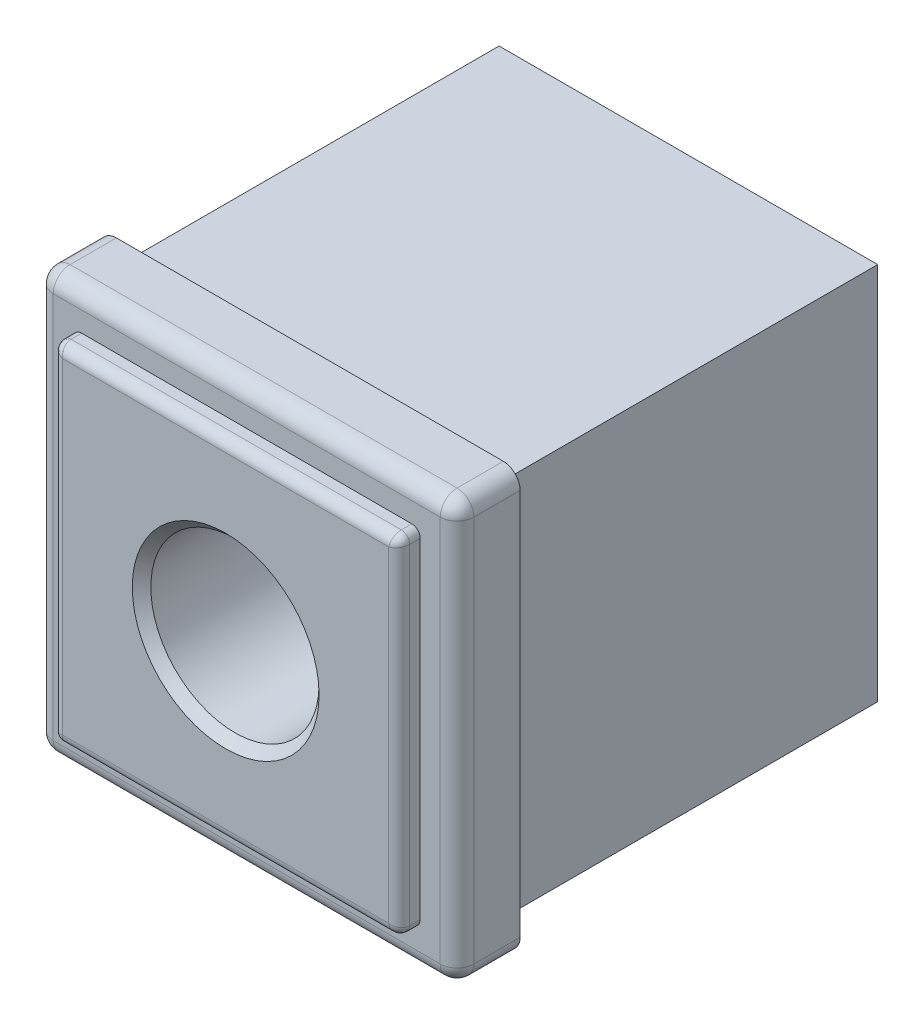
ISO-10303-21;
HEADER;
FILE_DESCRIPTION(('STEP AP214'),'2;1');
FILE_NAME('part.step','',(''),(''),'','','');
FILE_SCHEMA(('AUTOMOTIVE_DESIGN { 1 0 10303 214 1 1 1 1 }'));
ENDSEC;
DATA;
#1=APPLICATION_CONTEXT('core data for automotive mechanical design processes');
#2=APPLICATION_PROTOCOL_DEFINITION('international standard','automotive_design',2000,#1);
#3=PRODUCT_CONTEXT('',#1,'mechanical');
#4=PRODUCT('Part','Part','',(#3));
#5=PRODUCT_RELATED_PRODUCT_CATEGORY('part','',(#4));
#6=PRODUCT_DEFINITION_FORMATION('','',#4);
#7=PRODUCT_DEFINITION_CONTEXT('part definition',#1,'design');
#8=PRODUCT_DEFINITION('design','',#6,#7);
#9=PRODUCT_DEFINITION_SHAPE('','',#8);
#10=(LENGTH_UNIT() NAMED_UNIT(*) SI_UNIT(.MILLI.,.METRE.));
#11=(NAMED_UNIT(*) PLANE_ANGLE_UNIT() SI_UNIT($,.RADIAN.));
#12=(NAMED_UNIT(*) SI_UNIT($,.STERADIAN.) SOLID_ANGLE_UNIT());
#13=UNCERTAINTY_MEASURE_WITH_UNIT(LENGTH_MEASURE(1.E-05),#10,'distance_accuracy_value','');
#14=(GEOMETRIC_REPRESENTATION_CONTEXT(3) GLOBAL_UNCERTAINTY_ASSIGNED_CONTEXT((#13)) GLOBAL_UNIT_ASSIGNED_CONTEXT((#10,
#11,#12)) REPRESENTATION_CONTEXT('',''));
#15=CARTESIAN_POINT('',(0.,0.,0.));
#16=DIRECTION('',(0.,0.,1.));
#17=DIRECTION('',(1.,0.,0.));
#18=AXIS2_PLACEMENT_3D('',#15,#16,#17);
#19=CARTESIAN_POINT('',(25.,25.,7.5));
#20=DIRECTION('',(0.,0.,1.));
#21=DIRECTION('',(1.,0.,0.));
#22=AXIS2_PLACEMENT_3D('',#19,#20,#21);
#23=PLANE('',#22);
#24=DIRECTION('',(0.,1.,0.));
#25=VECTOR('',#24,1.);
#26=CARTESIAN_POINT('',(23.,23.,7.5));
#27=LINE('',#26,#25);
#28=CARTESIAN_POINT('',(23.,-23.,7.5));
#29=VERTEX_POINT('',#28);
#30=CARTESIAN_POINT('',(23.,23.,7.5));
#31=VERTEX_POINT('',#30);
#32=EDGE_CURVE('E728',#29,#31,#27,.T.);
#33=ORIENTED_EDGE('',*,*,#32,.T.);
#34=DIRECTION('',(-1.,0.,0.));
#35=VECTOR('',#34,1.);
#36=CARTESIAN_POINT('',(-23.,23.,7.5));
#37=LINE('',#36,#35);
#38=CARTESIAN_POINT('',(-23.,23.,7.5));
#39=VERTEX_POINT('',#38);
#40=EDGE_CURVE('E723',#31,#39,#37,.T.);
#41=ORIENTED_EDGE('',*,*,#40,.T.);
#42=DIRECTION('',(0.,-1.,0.));
#43=VECTOR('',#42,1.);
#44=CARTESIAN_POINT('',(-23.,-23.,7.5));
#45=LINE('',#44,#43);
#46=CARTESIAN_POINT('',(-23.,-23.,7.5));
#47=VERTEX_POINT('',#46);
#48=EDGE_CURVE('E726',#39,#47,#45,.T.);
#49=ORIENTED_EDGE('',*,*,#48,.T.);
#50=DIRECTION('',(1.,0.,0.));
#51=VECTOR('',#50,1.);
#52=CARTESIAN_POINT('',(23.,-23.,7.5));
#53=LINE('',#52,#51);
#54=EDGE_CURVE('E730',#47,#29,#53,.T.);
#55=ORIENTED_EDGE('',*,*,#54,.T.);
#56=EDGE_LOOP('',(#33,#41,#49,#55));
#57=FACE_BOUND('',#56,.T.);
#58=DIRECTION('',(1.,0.,0.));
#59=VECTOR('',#58,1.);
#60=CARTESIAN_POINT('',(-20.625,-20.625,7.5));
#61=LINE('',#60,#59);
#62=CARTESIAN_POINT('',(-19.625,-20.625,7.5));
#63=VERTEX_POINT('',#62);
#64=CARTESIAN_POINT('',(19.625,-20.625,7.5));
#65=VERTEX_POINT('',#64);
#66=EDGE_CURVE('E805',#63,#65,#61,.T.);
#67=ORIENTED_EDGE('',*,*,#66,.F.);
#68=CARTESIAN_POINT('',(-19.625,-19.625,7.5));
#69=DIRECTION('',(0.,0.,1.));
#70=DIRECTION('',(1.,0.,0.));
#71=AXIS2_PLACEMENT_3D('',#68,#69,#70);
#72=CIRCLE('',#71,1.);
#73=CARTESIAN_POINT('',(-20.625,-19.625,7.5));
#74=VERTEX_POINT('',#73);
#75=EDGE_CURVE('E734',#63,#74,#72,.F.);
#76=ORIENTED_EDGE('',*,*,#75,.T.);
#77=DIRECTION('',(0.,-1.,0.));
#78=VECTOR('',#77,1.);
#79=CARTESIAN_POINT('',(-20.625,20.625,7.5));
#80=LINE('',#79,#78);
#81=CARTESIAN_POINT('',(-20.625,19.625,7.5));
#82=VERTEX_POINT('',#81);
#83=EDGE_CURVE('E808',#82,#74,#80,.T.);
#84=ORIENTED_EDGE('',*,*,#83,.F.);
#85=CARTESIAN_POINT('',(-19.625,19.625,7.5));
#86=DIRECTION('',(0.,0.,1.));
#87=DIRECTION('',(1.,0.,0.));
#88=AXIS2_PLACEMENT_3D('',#85,#86,#87);
#89=CIRCLE('',#88,1.);
#90=CARTESIAN_POINT('',(-19.625,20.625,7.5));
#91=VERTEX_POINT('',#90);
#92=EDGE_CURVE('E738',#82,#91,#89,.F.);
#93=ORIENTED_EDGE('',*,*,#92,.T.);
#94=DIRECTION('',(-1.,0.,0.));
#95=VECTOR('',#94,1.);
#96=CARTESIAN_POINT('',(-20.625,20.625,7.5));
#97=LINE('',#96,#95);
#98=CARTESIAN_POINT('',(19.625,20.625,7.5));
#99=VERTEX_POINT('',#98);
#100=EDGE_CURVE('E799',#99,#91,#97,.T.);
#101=ORIENTED_EDGE('',*,*,#100,.F.);
#102=CARTESIAN_POINT('',(19.625,19.625,7.5));
#103=DIRECTION('',(0.,0.,1.));
#104=DIRECTION('',(1.,0.,0.));
#105=AXIS2_PLACEMENT_3D('',#102,#103,#104);
#106=CIRCLE('',#105,1.);
#107=CARTESIAN_POINT('',(20.625,19.625,7.5));
#108=VERTEX_POINT('',#107);
#109=EDGE_CURVE('E736',#99,#108,#106,.F.);
#110=ORIENTED_EDGE('',*,*,#109,.T.);
#111=DIRECTION('',(0.,1.,0.));
#112=VECTOR('',#111,1.);
#113=CARTESIAN_POINT('',(20.625,20.625,7.5));
#114=LINE('',#113,#112);
#115=CARTESIAN_POINT('',(20.625,-19.625,7.5));
#116=VERTEX_POINT('',#115);
#117=EDGE_CURVE('E802',#116,#108,#114,.T.);
#118=ORIENTED_EDGE('',*,*,#117,.F.);
#119=CARTESIAN_POINT('',(19.625,-19.625,7.5));
#120=DIRECTION('',(0.,0.,1.));
#121=DIRECTION('',(1.,0.,0.));
#122=AXIS2_PLACEMENT_3D('',#119,#120,#121);
#123=CIRCLE('',#122,1.);
#124=EDGE_CURVE('E732',#116,#65,#123,.F.);
#125=ORIENTED_EDGE('',*,*,#124,.T.);
#126=EDGE_LOOP('',(#67,#76,#84,#93,#101,#110,#118,#125));
#127=FACE_BOUND('',#126,.T.);
#128=ADVANCED_FACE('F14',(#57,#127),#23,.T.);
#129=CARTESIAN_POINT('',(-22.75,-22.75,-45.));
#130=DIRECTION('',(0.,0.,-1.));
#131=DIRECTION('',(-1.,0.,0.));
#132=AXIS2_PLACEMENT_3D('',#129,#130,#131);
#133=PLANE('',#132);
#134=DIRECTION('',(1.,0.,0.));
#135=VECTOR('',#134,1.);
#136=CARTESIAN_POINT('',(-22.5,22.5,-45.));
#137=LINE('',#136,#135);
#138=CARTESIAN_POINT('',(-22.5,22.5,-45.));
#139=VERTEX_POINT('',#138);
#140=CARTESIAN_POINT('',(22.5,22.5,-45.));
#141=VERTEX_POINT('',#140);
#142=EDGE_CURVE('E29',#139,#141,#137,.T.);
#143=ORIENTED_EDGE('',*,*,#142,.T.);
#144=DIRECTION('',(0.,-1.,0.));
#145=VECTOR('',#144,1.);
#146=CARTESIAN_POINT('',(22.5,22.5,-45.));
#147=LINE('',#146,#145);
#148=CARTESIAN_POINT('',(22.5,-22.5,-45.));
#149=VERTEX_POINT('',#148);
#150=EDGE_CURVE('E187',#141,#149,#147,.T.);
#151=ORIENTED_EDGE('',*,*,#150,.T.);
#152=DIRECTION('',(-1.,0.,0.));
#153=VECTOR('',#152,1.);
#154=CARTESIAN_POINT('',(22.5,-22.5,-45.));
#155=LINE('',#154,#153);
#156=CARTESIAN_POINT('',(-22.5,-22.5,-45.));
#157=VERTEX_POINT('',#156);
#158=EDGE_CURVE('E192',#149,#157,#155,.T.);
#159=ORIENTED_EDGE('',*,*,#158,.T.);
#160=DIRECTION('',(0.,1.,0.));
#161=VECTOR('',#160,1.);
#162=CARTESIAN_POINT('',(-22.5,-22.5,-45.));
#163=LINE('',#162,#161);
#164=EDGE_CURVE('E198',#157,#139,#163,.T.);
#165=ORIENTED_EDGE('',*,*,#164,.T.);
#166=EDGE_LOOP('',(#143,#151,#159,#165));
#167=FACE_BOUND('',#166,.T.);
#168=CARTESIAN_POINT('',(0.,0.,-45.));
#169=DIRECTION('',(0.,0.,1.));
#170=DIRECTION('',(1.,0.,0.));
#171=AXIS2_PLACEMENT_3D('',#168,#169,#170);
#172=CIRCLE('',#171,10.);
#173=CARTESIAN_POINT('',(10.,0.,-45.));
#174=VERTEX_POINT('',#173);
#175=EDGE_CURVE('E183',#174,#174,#172,.T.);
#176=ORIENTED_EDGE('',*,*,#175,.T.);
#177=EDGE_LOOP('',(#176));
#178=FACE_BOUND('',#177,.T.);
#179=ADVANCED_FACE('F195',(#167,#178),#133,.T.);
#180=CARTESIAN_POINT('',(25.,25.,0.));
#181=DIRECTION('',(0.,0.,1.));
#182=DIRECTION('',(1.,0.,0.));
#183=AXIS2_PLACEMENT_3D('',#180,#181,#182);
#184=PLANE('',#183);
#185=DIRECTION('',(-1.,0.,0.));
#186=VECTOR('',#185,1.);
#187=CARTESIAN_POINT('',(-25.,25.,0.));
#188=LINE('',#187,#186);
#189=CARTESIAN_POINT('',(23.,25.,0.));
#190=VERTEX_POINT('',#189);
#191=CARTESIAN_POINT('',(-23.,25.,0.));
#192=VERTEX_POINT('',#191);
#193=EDGE_CURVE('E793',#190,#192,#188,.T.);
#194=ORIENTED_EDGE('',*,*,#193,.F.);
#195=CARTESIAN_POINT('',(23.,23.,0.));
#196=DIRECTION('',(0.,0.,1.));
#197=DIRECTION('',(1.,0.,0.));
#198=AXIS2_PLACEMENT_3D('',#195,#196,#197);
#199=CIRCLE('',#198,2.);
#200=CARTESIAN_POINT('',(25.,23.,0.));
#201=VERTEX_POINT('',#200);
#202=EDGE_CURVE('E774',#190,#201,#199,.F.);
#203=ORIENTED_EDGE('',*,*,#202,.T.);
#204=DIRECTION('',(0.,1.,0.));
#205=VECTOR('',#204,1.);
#206=CARTESIAN_POINT('',(25.,25.,0.));
#207=LINE('',#206,#205);
#208=CARTESIAN_POINT('',(25.,-23.,0.));
#209=VERTEX_POINT('',#208);
#210=EDGE_CURVE('E796',#209,#201,#207,.T.);
#211=ORIENTED_EDGE('',*,*,#210,.F.);
#212=CARTESIAN_POINT('',(23.,-23.,0.));
#213=DIRECTION('',(0.,0.,1.));
#214=DIRECTION('',(1.,0.,0.));
#215=AXIS2_PLACEMENT_3D('',#212,#213,#214);
#216=CIRCLE('',#215,2.);
#217=CARTESIAN_POINT('',(23.,-25.,0.));
#218=VERTEX_POINT('',#217);
#219=EDGE_CURVE('E778',#209,#218,#216,.F.);
#220=ORIENTED_EDGE('',*,*,#219,.T.);
#221=DIRECTION('',(1.,0.,0.));
#222=VECTOR('',#221,1.);
#223=CARTESIAN_POINT('',(-25.,-25.,0.));
#224=LINE('',#223,#222);
#225=CARTESIAN_POINT('',(-23.,-25.,0.));
#226=VERTEX_POINT('',#225);
#227=EDGE_CURVE('E787',#226,#218,#224,.T.);
#228=ORIENTED_EDGE('',*,*,#227,.F.);
#229=CARTESIAN_POINT('',(-23.,-23.,0.));
#230=DIRECTION('',(0.,0.,1.));
#231=DIRECTION('',(1.,0.,0.));
#232=AXIS2_PLACEMENT_3D('',#229,#230,#231);
#233=CIRCLE('',#232,2.);
#234=CARTESIAN_POINT('',(-25.,-23.,0.));
#235=VERTEX_POINT('',#234);
#236=EDGE_CURVE('E780',#226,#235,#233,.F.);
#237=ORIENTED_EDGE('',*,*,#236,.T.);
#238=DIRECTION('',(0.,-1.,0.));
#239=VECTOR('',#238,1.);
#240=CARTESIAN_POINT('',(-25.,25.,0.));
#241=LINE('',#240,#239);
#242=CARTESIAN_POINT('',(-25.,23.,0.));
#243=VERTEX_POINT('',#242);
#244=EDGE_CURVE('E790',#243,#235,#241,.T.);
#245=ORIENTED_EDGE('',*,*,#244,.F.);
#246=CARTESIAN_POINT('',(-23.,23.,0.));
#247=DIRECTION('',(0.,0.,1.));
#248=DIRECTION('',(1.,0.,0.));
#249=AXIS2_PLACEMENT_3D('',#246,#247,#248);
#250=CIRCLE('',#249,2.);
#251=EDGE_CURVE('E776',#243,#192,#250,.F.);
#252=ORIENTED_EDGE('',*,*,#251,.T.);
#253=EDGE_LOOP('',(#194,#203,#211,#220,#228,#237,#245,#252));
#254=FACE_BOUND('',#253,.T.);
#255=DIRECTION('',(1.,0.,0.));
#256=VECTOR('',#255,1.);
#257=CARTESIAN_POINT('',(-22.5,22.5,0.));
#258=LINE('',#257,#256);
#259=CARTESIAN_POINT('',(-22.5,22.5,0.));
#260=VERTEX_POINT('',#259);
#261=CARTESIAN_POINT('',(22.5,22.5,0.));
#262=VERTEX_POINT('',#261);
#263=EDGE_CURVE('E180',#260,#262,#258,.T.);
#264=ORIENTED_EDGE('',*,*,#263,.F.);
#265=DIRECTION('',(0.,1.,0.));
#266=VECTOR('',#265,1.);
#267=CARTESIAN_POINT('',(-22.5,-22.5,0.));
#268=LINE('',#267,#266);
#269=CARTESIAN_POINT('',(-22.5,-22.5,0.));
#270=VERTEX_POINT('',#269);
#271=EDGE_CURVE('E199',#270,#260,#268,.T.);
#272=ORIENTED_EDGE('',*,*,#271,.F.);
#273=DIRECTION('',(-1.,0.,0.));
#274=VECTOR('',#273,1.);
#275=CARTESIAN_POINT('',(22.5,-22.5,0.));
#276=LINE('',#275,#274);
#277=CARTESIAN_POINT('',(22.5,-22.5,0.));
#278=VERTEX_POINT('',#277);
#279=EDGE_CURVE('E202',#278,#270,#276,.T.);
#280=ORIENTED_EDGE('',*,*,#279,.F.);
#281=DIRECTION('',(0.,-1.,0.));
#282=VECTOR('',#281,1.);
#283=CARTESIAN_POINT('',(22.5,22.5,0.));
#284=LINE('',#283,#282);
#285=EDGE_CURVE('E209',#262,#278,#284,.T.);
#286=ORIENTED_EDGE('',*,*,#285,.F.);
#287=EDGE_LOOP('',(#264,#272,#280,#286));
#288=FACE_BOUND('',#287,.T.);
#289=ADVANCED_FACE('F366',(#254,#288),#184,.F.);
#290=CARTESIAN_POINT('',(25.,25.,7.5));
#291=DIRECTION('',(-1.,0.,0.));
#292=DIRECTION('',(0.,-1.,0.));
#293=AXIS2_PLACEMENT_3D('',#290,#291,#292);
#294=PLANE('',#293);
#295=DIRECTION('',(0.,0.,-1.));
#296=VECTOR('',#295,1.);
#297=CARTESIAN_POINT('',(25.,23.,7.5));
#298=LINE('',#297,#296);
#299=CARTESIAN_POINT('',(25.,23.,5.5));
#300=VERTEX_POINT('',#299);
#301=EDGE_CURVE('E769',#201,#300,#298,.F.);
#302=ORIENTED_EDGE('',*,*,#301,.T.);
#303=DIRECTION('',(0.,1.,0.));
#304=VECTOR('',#303,1.);
#305=CARTESIAN_POINT('',(25.,-23.,5.5));
#306=LINE('',#305,#304);
#307=CARTESIAN_POINT('',(25.,-23.,5.5));
#308=VERTEX_POINT('',#307);
#309=EDGE_CURVE('E712',#300,#308,#306,.F.);
#310=ORIENTED_EDGE('',*,*,#309,.T.);
#311=DIRECTION('',(0.,0.,-1.));
#312=VECTOR('',#311,1.);
#313=CARTESIAN_POINT('',(25.,-23.,7.5));
#314=LINE('',#313,#312);
#315=EDGE_CURVE('E772',#308,#209,#314,.T.);
#316=ORIENTED_EDGE('',*,*,#315,.T.);
#317=ORIENTED_EDGE('',*,*,#210,.T.);
#318=EDGE_LOOP('',(#302,#310,#316,#317));
#319=FACE_BOUND('',#318,.T.);
#320=ADVANCED_FACE('F369',(#319),#294,.F.);
#321=CARTESIAN_POINT('',(-25.,25.,7.5));
#322=DIRECTION('',(0.,-1.,0.));
#323=DIRECTION('',(0.,0.,-1.));
#324=AXIS2_PLACEMENT_3D('',#321,#322,#323);
#325=PLANE('',#324);
#326=DIRECTION('',(0.,0.,-1.));
#327=VECTOR('',#326,1.);
#328=CARTESIAN_POINT('',(-23.,25.,7.5));
#329=LINE('',#328,#327);
#330=CARTESIAN_POINT('',(-23.,25.,5.5));
#331=VERTEX_POINT('',#330);
#332=EDGE_CURVE('E784',#192,#331,#329,.F.);
#333=ORIENTED_EDGE('',*,*,#332,.T.);
#334=DIRECTION('',(-1.,0.,0.));
#335=VECTOR('',#334,1.);
#336=CARTESIAN_POINT('',(23.,25.,5.5));
#337=LINE('',#336,#335);
#338=CARTESIAN_POINT('',(23.,25.,5.5));
#339=VERTEX_POINT('',#338);
#340=EDGE_CURVE('E720',#331,#339,#337,.F.);
#341=ORIENTED_EDGE('',*,*,#340,.T.);
#342=DIRECTION('',(0.,0.,-1.));
#343=VECTOR('',#342,1.);
#344=CARTESIAN_POINT('',(23.,25.,7.5));
#345=LINE('',#344,#343);
#346=EDGE_CURVE('E782',#339,#190,#345,.T.);
#347=ORIENTED_EDGE('',*,*,#346,.T.);
#348=ORIENTED_EDGE('',*,*,#193,.T.);
#349=EDGE_LOOP('',(#333,#341,#347,#348));
#350=FACE_BOUND('',#349,.T.);
#351=ADVANCED_FACE('F380',(#350),#325,.F.);
#352=CARTESIAN_POINT('',(-25.,25.,7.5));
#353=DIRECTION('',(1.,0.,0.));
#354=DIRECTION('',(0.,1.,0.));
#355=AXIS2_PLACEMENT_3D('',#352,#353,#354);
#356=PLANE('',#355);
#357=DIRECTION('',(0.,0.,-1.));
#358=VECTOR('',#357,1.);
#359=CARTESIAN_POINT('',(-25.,-23.,7.5));
#360=LINE('',#359,#358);
#361=CARTESIAN_POINT('',(-25.,-23.,5.5));
#362=VERTEX_POINT('',#361);
#363=EDGE_CURVE('E766',#235,#362,#360,.F.);
#364=ORIENTED_EDGE('',*,*,#363,.T.);
#365=DIRECTION('',(0.,-1.,0.));
#366=VECTOR('',#365,1.);
#367=CARTESIAN_POINT('',(-25.,23.,5.5));
#368=LINE('',#367,#366);
#369=CARTESIAN_POINT('',(-25.,23.,5.5));
#370=VERTEX_POINT('',#369);
#371=EDGE_CURVE('E714',#362,#370,#368,.F.);
#372=ORIENTED_EDGE('',*,*,#371,.T.);
#373=DIRECTION('',(0.,0.,-1.));
#374=VECTOR('',#373,1.);
#375=CARTESIAN_POINT('',(-25.,23.,7.5));
#376=LINE('',#375,#374);
#377=EDGE_CURVE('E764',#370,#243,#376,.T.);
#378=ORIENTED_EDGE('',*,*,#377,.T.);
#379=ORIENTED_EDGE('',*,*,#244,.T.);
#380=EDGE_LOOP('',(#364,#372,#378,#379));
#381=FACE_BOUND('',#380,.T.);
#382=ADVANCED_FACE('F376',(#381),#356,.F.);
#383=CARTESIAN_POINT('',(-25.,-25.,7.5));
#384=DIRECTION('',(0.,1.,0.));
#385=DIRECTION('',(-1.,0.,0.));
#386=AXIS2_PLACEMENT_3D('',#383,#384,#385);
#387=PLANE('',#386);
#388=DIRECTION('',(0.,0.,-1.));
#389=VECTOR('',#388,1.);
#390=CARTESIAN_POINT('',(23.,-25.,7.5));
#391=LINE('',#390,#389);
#392=CARTESIAN_POINT('',(23.,-25.,5.5));
#393=VERTEX_POINT('',#392);
#394=EDGE_CURVE('E759',#218,#393,#391,.F.);
#395=ORIENTED_EDGE('',*,*,#394,.T.);
#396=DIRECTION('',(1.,0.,0.));
#397=VECTOR('',#396,1.);
#398=CARTESIAN_POINT('',(-23.,-25.,5.5));
#399=LINE('',#398,#397);
#400=CARTESIAN_POINT('',(-23.,-25.,5.5));
#401=VERTEX_POINT('',#400);
#402=EDGE_CURVE('E706',#393,#401,#399,.F.);
#403=ORIENTED_EDGE('',*,*,#402,.T.);
#404=DIRECTION('',(0.,0.,-1.));
#405=VECTOR('',#404,1.);
#406=CARTESIAN_POINT('',(-23.,-25.,7.5));
#407=LINE('',#406,#405);
#408=EDGE_CURVE('E762',#401,#226,#407,.T.);
#409=ORIENTED_EDGE('',*,*,#408,.T.);
#410=ORIENTED_EDGE('',*,*,#227,.T.);
#411=EDGE_LOOP('',(#395,#403,#409,#410));
#412=FACE_BOUND('',#411,.T.);
#413=ADVANCED_FACE('F364',(#412),#387,.F.);
#414=CARTESIAN_POINT('',(-20.625,20.625,10.));
#415=DIRECTION('',(1.,0.,0.));
#416=DIRECTION('',(0.,0.,-1.));
#417=AXIS2_PLACEMENT_3D('',#414,#415,#416);
#418=PLANE('',#417);
#419=DIRECTION('',(0.,0.,-1.));
#420=VECTOR('',#419,1.);
#421=CARTESIAN_POINT('',(-20.625,-19.625,10.));
#422=LINE('',#421,#420);
#423=CARTESIAN_POINT('',(-20.625,-19.625,8.75));
#424=VERTEX_POINT('',#423);
#425=EDGE_CURVE('E756',#74,#424,#422,.F.);
#426=ORIENTED_EDGE('',*,*,#425,.T.);
#427=DIRECTION('',(0.,-1.,0.));
#428=VECTOR('',#427,1.);
#429=CARTESIAN_POINT('',(-20.625,19.625,8.75));
#430=LINE('',#429,#428);
#431=CARTESIAN_POINT('',(-20.625,19.625,8.75));
#432=VERTEX_POINT('',#431);
#433=EDGE_CURVE('E694',#424,#432,#430,.F.);
#434=ORIENTED_EDGE('',*,*,#433,.T.);
#435=DIRECTION('',(0.,0.,-1.));
#436=VECTOR('',#435,1.);
#437=CARTESIAN_POINT('',(-20.625,19.625,10.));
#438=LINE('',#437,#436);
#439=EDGE_CURVE('E754',#432,#82,#438,.T.);
#440=ORIENTED_EDGE('',*,*,#439,.T.);
#441=ORIENTED_EDGE('',*,*,#83,.T.);
#442=EDGE_LOOP('',(#426,#434,#440,#441));
#443=FACE_BOUND('',#442,.T.);
#444=ADVANCED_FACE('F360',(#443),#418,.F.);
#445=CARTESIAN_POINT('',(-20.625,-20.625,10.));
#446=DIRECTION('',(0.,1.,0.));
#447=DIRECTION('',(-1.,0.,0.));
#448=AXIS2_PLACEMENT_3D('',#445,#446,#447);
#449=PLANE('',#448);
#450=DIRECTION('',(0.,0.,-1.));
#451=VECTOR('',#450,1.);
#452=CARTESIAN_POINT('',(19.625,-20.625,10.));
#453=LINE('',#452,#451);
#454=CARTESIAN_POINT('',(19.625,-20.625,8.75));
#455=VERTEX_POINT('',#454);
#456=EDGE_CURVE('E742',#65,#455,#453,.F.);
#457=ORIENTED_EDGE('',*,*,#456,.T.);
#458=DIRECTION('',(1.,0.,0.));
#459=VECTOR('',#458,1.);
#460=CARTESIAN_POINT('',(-19.625,-20.625,8.75));
#461=LINE('',#460,#459);
#462=CARTESIAN_POINT('',(-19.625,-20.625,8.75));
#463=VERTEX_POINT('',#462);
#464=EDGE_CURVE('E688',#455,#463,#461,.F.);
#465=ORIENTED_EDGE('',*,*,#464,.T.);
#466=DIRECTION('',(0.,0.,-1.));
#467=VECTOR('',#466,1.);
#468=CARTESIAN_POINT('',(-19.625,-20.625,10.));
#469=LINE('',#468,#467);
#470=EDGE_CURVE('E740',#463,#63,#469,.T.);
#471=ORIENTED_EDGE('',*,*,#470,.T.);
#472=ORIENTED_EDGE('',*,*,#66,.T.);
#473=EDGE_LOOP('',(#457,#465,#471,#472));
#474=FACE_BOUND('',#473,.T.);
#475=ADVANCED_FACE('F356',(#474),#449,.F.);
#476=CARTESIAN_POINT('',(20.625,20.625,10.));
#477=DIRECTION('',(-1.,0.,0.));
#478=DIRECTION('',(0.,-1.,0.));
#479=AXIS2_PLACEMENT_3D('',#476,#477,#478);
#480=PLANE('',#479);
#481=DIRECTION('',(0.,0.,-1.));
#482=VECTOR('',#481,1.);
#483=CARTESIAN_POINT('',(20.625,19.625,10.));
#484=LINE('',#483,#482);
#485=CARTESIAN_POINT('',(20.625,19.625,8.75));
#486=VERTEX_POINT('',#485);
#487=EDGE_CURVE('E745',#108,#486,#484,.F.);
#488=ORIENTED_EDGE('',*,*,#487,.T.);
#489=DIRECTION('',(0.,1.,0.));
#490=VECTOR('',#489,1.);
#491=CARTESIAN_POINT('',(20.625,-19.625,8.75));
#492=LINE('',#491,#490);
#493=CARTESIAN_POINT('',(20.625,-19.625,8.75));
#494=VERTEX_POINT('',#493);
#495=EDGE_CURVE('E680',#486,#494,#492,.F.);
#496=ORIENTED_EDGE('',*,*,#495,.T.);
#497=DIRECTION('',(0.,0.,-1.));
#498=VECTOR('',#497,1.);
#499=CARTESIAN_POINT('',(20.625,-19.625,10.));
#500=LINE('',#499,#498);
#501=EDGE_CURVE('E747',#494,#116,#500,.T.);
#502=ORIENTED_EDGE('',*,*,#501,.T.);
#503=ORIENTED_EDGE('',*,*,#117,.T.);
#504=EDGE_LOOP('',(#488,#496,#502,#503));
#505=FACE_BOUND('',#504,.T.);
#506=ADVANCED_FACE('F352',(#505),#480,.F.);
#507=CARTESIAN_POINT('',(-20.625,20.625,10.));
#508=DIRECTION('',(0.,-1.,0.));
#509=DIRECTION('',(1.,0.,0.));
#510=AXIS2_PLACEMENT_3D('',#507,#508,#509);
#511=PLANE('',#510);
#512=DIRECTION('',(0.,0.,-1.));
#513=VECTOR('',#512,1.);
#514=CARTESIAN_POINT('',(-19.625,20.625,10.));
#515=LINE('',#514,#513);
#516=CARTESIAN_POINT('',(-19.625,20.625,8.75));
#517=VERTEX_POINT('',#516);
#518=EDGE_CURVE('E749',#91,#517,#515,.F.);
#519=ORIENTED_EDGE('',*,*,#518,.T.);
#520=DIRECTION('',(-1.,0.,0.));
#521=VECTOR('',#520,1.);
#522=CARTESIAN_POINT('',(19.625,20.625,8.75));
#523=LINE('',#522,#521);
#524=CARTESIAN_POINT('',(19.625,20.625,8.75));
#525=VERTEX_POINT('',#524);
#526=EDGE_CURVE('E686',#517,#525,#523,.F.);
#527=ORIENTED_EDGE('',*,*,#526,.T.);
#528=DIRECTION('',(0.,0.,-1.));
#529=VECTOR('',#528,1.);
#530=CARTESIAN_POINT('',(19.625,20.625,10.));
#531=LINE('',#530,#529);
#532=EDGE_CURVE('E752',#525,#99,#531,.T.);
#533=ORIENTED_EDGE('',*,*,#532,.T.);
#534=ORIENTED_EDGE('',*,*,#100,.T.);
#535=EDGE_LOOP('',(#519,#527,#533,#534));
#536=FACE_BOUND('',#535,.T.);
#537=ADVANCED_FACE('F348',(#536),#511,.F.);
#538=CARTESIAN_POINT('',(-20.625,-20.625,10.));
#539=DIRECTION('',(0.,0.,1.));
#540=DIRECTION('',(1.,0.,0.));
#541=AXIS2_PLACEMENT_3D('',#538,#539,#540);
#542=PLANE('',#541);
#543=CARTESIAN_POINT('',(0.,0.,10.));
#544=DIRECTION('',(0.,0.,1.));
#545=DIRECTION('',(1.,0.,0.));
#546=AXIS2_PLACEMENT_3D('',#543,#544,#545);
#547=CIRCLE('',#546,11.1);
#548=CARTESIAN_POINT('',(11.1,0.,10.));
#549=VERTEX_POINT('',#548);
#550=EDGE_CURVE('E9',#549,#549,#547,.F.);
#551=ORIENTED_EDGE('',*,*,#550,.T.);
#552=EDGE_LOOP('',(#551));
#553=FACE_BOUND('',#552,.T.);
#554=DIRECTION('',(-1.,0.,0.));
#555=VECTOR('',#554,1.);
#556=CARTESIAN_POINT('',(-19.625,19.375,10.));
#557=LINE('',#556,#555);
#558=CARTESIAN_POINT('',(19.375,19.375,10.));
#559=VERTEX_POINT('',#558);
#560=CARTESIAN_POINT('',(-19.375,19.375,10.));
#561=VERTEX_POINT('',#560);
#562=EDGE_CURVE('E702',#559,#561,#557,.T.);
#563=ORIENTED_EDGE('',*,*,#562,.T.);
#564=DIRECTION('',(0.,-1.,0.));
#565=VECTOR('',#564,1.);
#566=CARTESIAN_POINT('',(-19.375,-19.625,10.));
#567=LINE('',#566,#565);
#568=CARTESIAN_POINT('',(-19.375,-19.375,10.));
#569=VERTEX_POINT('',#568);
#570=EDGE_CURVE('E697',#561,#569,#567,.T.);
#571=ORIENTED_EDGE('',*,*,#570,.T.);
#572=DIRECTION('',(1.,0.,0.));
#573=VECTOR('',#572,1.);
#574=CARTESIAN_POINT('',(19.625,-19.375,10.));
#575=LINE('',#574,#573);
#576=CARTESIAN_POINT('',(19.375,-19.375,10.));
#577=VERTEX_POINT('',#576);
#578=EDGE_CURVE('E700',#569,#577,#575,.T.);
#579=ORIENTED_EDGE('',*,*,#578,.T.);
#580=DIRECTION('',(0.,1.,0.));
#581=VECTOR('',#580,1.);
#582=CARTESIAN_POINT('',(19.375,19.625,10.));
#583=LINE('',#582,#581);
#584=EDGE_CURVE('E704',#577,#559,#583,.T.);
#585=ORIENTED_EDGE('',*,*,#584,.T.);
#586=EDGE_LOOP('',(#563,#571,#579,#585));
#587=FACE_BOUND('',#586,.T.);
#588=ADVANCED_FACE('F344',(#553,#587),#542,.T.);
#589=CARTESIAN_POINT('',(23.,23.,7.5));
#590=DIRECTION('',(0.,0.,-1.));
#591=DIRECTION('',(-1.,0.,0.));
#592=AXIS2_PLACEMENT_3D('',#589,#590,#591);
#593=CYLINDRICAL_SURFACE('',#592,2.);
#594=ORIENTED_EDGE('',*,*,#346,.F.);
#595=CARTESIAN_POINT('',(23.,23.,5.5));
#596=DIRECTION('',(0.,0.,-1.));
#597=DIRECTION('',(-1.,0.,0.));
#598=AXIS2_PLACEMENT_3D('',#595,#596,#597);
#599=CIRCLE('',#598,2.);
#600=EDGE_CURVE('E716',#339,#300,#599,.T.);
#601=ORIENTED_EDGE('',*,*,#600,.T.);
#602=ORIENTED_EDGE('',*,*,#301,.F.);
#603=ORIENTED_EDGE('',*,*,#202,.F.);
#604=EDGE_LOOP('',(#594,#601,#602,#603));
#605=FACE_BOUND('',#604,.T.);
#606=ADVANCED_FACE('F340',(#605),#593,.T.);
#607=CARTESIAN_POINT('',(-23.,23.,7.5));
#608=DIRECTION('',(0.,0.,-1.));
#609=DIRECTION('',(-1.,0.,0.));
#610=AXIS2_PLACEMENT_3D('',#607,#608,#609);
#611=CYLINDRICAL_SURFACE('',#610,2.);
#612=ORIENTED_EDGE('',*,*,#377,.F.);
#613=CARTESIAN_POINT('',(-23.,23.,5.5));
#614=DIRECTION('',(0.,0.,-1.));
#615=DIRECTION('',(-1.,0.,0.));
#616=AXIS2_PLACEMENT_3D('',#613,#614,#615);
#617=CIRCLE('',#616,2.);
#618=EDGE_CURVE('E718',#370,#331,#617,.T.);
#619=ORIENTED_EDGE('',*,*,#618,.T.);
#620=ORIENTED_EDGE('',*,*,#332,.F.);
#621=ORIENTED_EDGE('',*,*,#251,.F.);
#622=EDGE_LOOP('',(#612,#619,#620,#621));
#623=FACE_BOUND('',#622,.T.);
#624=ADVANCED_FACE('F336',(#623),#611,.T.);
#625=CARTESIAN_POINT('',(23.,-23.,7.5));
#626=DIRECTION('',(0.,0.,-1.));
#627=DIRECTION('',(-1.,0.,0.));
#628=AXIS2_PLACEMENT_3D('',#625,#626,#627);
#629=CYLINDRICAL_SURFACE('',#628,2.);
#630=ORIENTED_EDGE('',*,*,#315,.F.);
#631=CARTESIAN_POINT('',(23.,-23.,5.5));
#632=DIRECTION('',(0.,0.,-1.));
#633=DIRECTION('',(-1.,0.,0.));
#634=AXIS2_PLACEMENT_3D('',#631,#632,#633);
#635=CIRCLE('',#634,2.);
#636=EDGE_CURVE('E708',#308,#393,#635,.T.);
#637=ORIENTED_EDGE('',*,*,#636,.T.);
#638=ORIENTED_EDGE('',*,*,#394,.F.);
#639=ORIENTED_EDGE('',*,*,#219,.F.);
#640=EDGE_LOOP('',(#630,#637,#638,#639));
#641=FACE_BOUND('',#640,.T.);
#642=ADVANCED_FACE('F332',(#641),#629,.T.);
#643=CARTESIAN_POINT('',(-23.,-23.,7.5));
#644=DIRECTION('',(0.,0.,-1.));
#645=DIRECTION('',(-1.,0.,0.));
#646=AXIS2_PLACEMENT_3D('',#643,#644,#645);
#647=CYLINDRICAL_SURFACE('',#646,2.);
#648=ORIENTED_EDGE('',*,*,#408,.F.);
#649=CARTESIAN_POINT('',(-23.,-23.,5.5));
#650=DIRECTION('',(0.,0.,-1.));
#651=DIRECTION('',(-1.,0.,0.));
#652=AXIS2_PLACEMENT_3D('',#649,#650,#651);
#653=CIRCLE('',#652,2.);
#654=EDGE_CURVE('E710',#401,#362,#653,.T.);
#655=ORIENTED_EDGE('',*,*,#654,.T.);
#656=ORIENTED_EDGE('',*,*,#363,.F.);
#657=ORIENTED_EDGE('',*,*,#236,.F.);
#658=EDGE_LOOP('',(#648,#655,#656,#657));
#659=FACE_BOUND('',#658,.T.);
#660=ADVANCED_FACE('F328',(#659),#647,.T.);
#661=CARTESIAN_POINT('',(-19.625,19.625,10.));
#662=DIRECTION('',(0.,0.,-1.));
#663=DIRECTION('',(-1.,0.,0.));
#664=AXIS2_PLACEMENT_3D('',#661,#662,#663);
#665=CYLINDRICAL_SURFACE('',#664,1.);
#666=ORIENTED_EDGE('',*,*,#439,.F.);
#667=CARTESIAN_POINT('',(-19.625,19.625,8.75));
#668=DIRECTION('',(0.,0.,-1.));
#669=DIRECTION('',(-1.,0.,0.));
#670=AXIS2_PLACEMENT_3D('',#667,#668,#669);
#671=CIRCLE('',#670,1.);
#672=EDGE_CURVE('E690',#432,#517,#671,.T.);
#673=ORIENTED_EDGE('',*,*,#672,.T.);
#674=ORIENTED_EDGE('',*,*,#518,.F.);
#675=ORIENTED_EDGE('',*,*,#92,.F.);
#676=EDGE_LOOP('',(#666,#673,#674,#675));
#677=FACE_BOUND('',#676,.T.);
#678=ADVANCED_FACE('F325',(#677),#665,.T.);
#679=CARTESIAN_POINT('',(19.625,19.625,10.));
#680=DIRECTION('',(0.,0.,-1.));
#681=DIRECTION('',(-1.,0.,0.));
#682=AXIS2_PLACEMENT_3D('',#679,#680,#681);
#683=CYLINDRICAL_SURFACE('',#682,1.);
#684=ORIENTED_EDGE('',*,*,#532,.F.);
#685=CARTESIAN_POINT('',(19.625,19.625,8.75));
#686=DIRECTION('',(0.,0.,-1.));
#687=DIRECTION('',(-1.,0.,0.));
#688=AXIS2_PLACEMENT_3D('',#685,#686,#687);
#689=CIRCLE('',#688,1.);
#690=EDGE_CURVE('E37',#525,#486,#689,.T.);
#691=ORIENTED_EDGE('',*,*,#690,.T.);
#692=ORIENTED_EDGE('',*,*,#487,.F.);
#693=ORIENTED_EDGE('',*,*,#109,.F.);
#694=EDGE_LOOP('',(#684,#691,#692,#693));
#695=FACE_BOUND('',#694,.T.);
#696=ADVANCED_FACE('F321',(#695),#683,.T.);
#697=CARTESIAN_POINT('',(-19.625,-19.625,10.));
#698=DIRECTION('',(0.,0.,-1.));
#699=DIRECTION('',(-1.,0.,0.));
#700=AXIS2_PLACEMENT_3D('',#697,#698,#699);
#701=CYLINDRICAL_SURFACE('',#700,1.);
#702=ORIENTED_EDGE('',*,*,#470,.F.);
#703=CARTESIAN_POINT('',(-19.625,-19.625,8.75));
#704=DIRECTION('',(0.,0.,-1.));
#705=DIRECTION('',(-1.,0.,0.));
#706=AXIS2_PLACEMENT_3D('',#703,#704,#705);
#707=CIRCLE('',#706,1.);
#708=EDGE_CURVE('E692',#463,#424,#707,.T.);
#709=ORIENTED_EDGE('',*,*,#708,.T.);
#710=ORIENTED_EDGE('',*,*,#425,.F.);
#711=ORIENTED_EDGE('',*,*,#75,.F.);
#712=EDGE_LOOP('',(#702,#709,#710,#711));
#713=FACE_BOUND('',#712,.T.);
#714=ADVANCED_FACE('F317',(#713),#701,.T.);
#715=CARTESIAN_POINT('',(19.625,-19.625,10.));
#716=DIRECTION('',(0.,0.,-1.));
#717=DIRECTION('',(-1.,0.,0.));
#718=AXIS2_PLACEMENT_3D('',#715,#716,#717);
#719=CYLINDRICAL_SURFACE('',#718,1.);
#720=ORIENTED_EDGE('',*,*,#501,.F.);
#721=CARTESIAN_POINT('',(19.625,-19.625,8.75));
#722=DIRECTION('',(0.,0.,-1.));
#723=DIRECTION('',(-1.,0.,0.));
#724=AXIS2_PLACEMENT_3D('',#721,#722,#723);
#725=CIRCLE('',#724,1.);
#726=EDGE_CURVE('E684',#494,#455,#725,.T.);
#727=ORIENTED_EDGE('',*,*,#726,.T.);
#728=ORIENTED_EDGE('',*,*,#456,.F.);
#729=ORIENTED_EDGE('',*,*,#124,.F.);
#730=EDGE_LOOP('',(#720,#727,#728,#729));
#731=FACE_BOUND('',#730,.T.);
#732=ADVANCED_FACE('F313',(#731),#719,.T.);
#733=CARTESIAN_POINT('',(25.,-23.,5.5));
#734=DIRECTION('',(-1.,0.,0.));
#735=DIRECTION('',(0.,-1.,0.));
#736=AXIS2_PLACEMENT_3D('',#733,#734,#735);
#737=CYLINDRICAL_SURFACE('',#736,2.);
#738=CARTESIAN_POINT('',(-23.,-23.,5.5));
#739=DIRECTION('',(-1.,0.,0.));
#740=DIRECTION('',(0.,0.,1.));
#741=AXIS2_PLACEMENT_3D('',#738,#739,#740);
#742=CIRCLE('',#741,2.);
#743=EDGE_CURVE('E814',#401,#47,#742,.T.);
#744=ORIENTED_EDGE('',*,*,#743,.F.);
#745=ORIENTED_EDGE('',*,*,#402,.F.);
#746=CARTESIAN_POINT('',(23.,-23.,5.5));
#747=DIRECTION('',(1.,0.,0.));
#748=DIRECTION('',(0.,0.,-1.));
#749=AXIS2_PLACEMENT_3D('',#746,#747,#748);
#750=CIRCLE('',#749,2.);
#751=EDGE_CURVE('E811',#29,#393,#750,.T.);
#752=ORIENTED_EDGE('',*,*,#751,.F.);
#753=ORIENTED_EDGE('',*,*,#54,.F.);
#754=EDGE_LOOP('',(#744,#745,#752,#753));
#755=FACE_BOUND('',#754,.T.);
#756=ADVANCED_FACE('F309',(#755),#737,.T.);
#757=CARTESIAN_POINT('',(23.,-23.,5.5));
#758=DIRECTION('',(0.,0.,1.));
#759=DIRECTION('',(1.,0.,0.));
#760=AXIS2_PLACEMENT_3D('',#757,#758,#759);
#761=SPHERICAL_SURFACE('',#760,2.);
#762=ORIENTED_EDGE('',*,*,#751,.T.);
#763=ORIENTED_EDGE('',*,*,#636,.F.);
#764=CARTESIAN_POINT('',(23.,-23.,5.5));
#765=DIRECTION('',(0.,1.,0.));
#766=DIRECTION('',(0.,0.,1.));
#767=AXIS2_PLACEMENT_3D('',#764,#765,#766);
#768=CIRCLE('',#767,2.);
#769=EDGE_CURVE('E817',#29,#308,#768,.T.);
#770=ORIENTED_EDGE('',*,*,#769,.F.);
#771=EDGE_LOOP('',(#762,#763,#770));
#772=FACE_BOUND('',#771,.T.);
#773=ADVANCED_FACE('F305',(#772),#761,.T.);
#774=CARTESIAN_POINT('',(-23.,-23.,5.5));
#775=DIRECTION('',(0.,0.,1.));
#776=DIRECTION('',(1.,0.,0.));
#777=AXIS2_PLACEMENT_3D('',#774,#775,#776);
#778=SPHERICAL_SURFACE('',#777,2.);
#779=ORIENTED_EDGE('',*,*,#654,.F.);
#780=ORIENTED_EDGE('',*,*,#743,.T.);
#781=CARTESIAN_POINT('',(-23.,-23.,5.5));
#782=DIRECTION('',(0.,1.,0.));
#783=DIRECTION('',(0.,0.,1.));
#784=AXIS2_PLACEMENT_3D('',#781,#782,#783);
#785=CIRCLE('',#784,2.);
#786=EDGE_CURVE('E820',#362,#47,#785,.T.);
#787=ORIENTED_EDGE('',*,*,#786,.F.);
#788=EDGE_LOOP('',(#779,#780,#787));
#789=FACE_BOUND('',#788,.T.);
#790=ADVANCED_FACE('F301',(#789),#778,.T.);
#791=CARTESIAN_POINT('',(23.,25.,5.5));
#792=DIRECTION('',(0.,-1.,0.));
#793=DIRECTION('',(1.,0.,0.));
#794=AXIS2_PLACEMENT_3D('',#791,#792,#793);
#795=CYLINDRICAL_SURFACE('',#794,2.);
#796=ORIENTED_EDGE('',*,*,#769,.T.);
#797=ORIENTED_EDGE('',*,*,#309,.F.);
#798=CARTESIAN_POINT('',(23.,23.,5.5));
#799=DIRECTION('',(0.,1.,0.));
#800=DIRECTION('',(0.,0.,1.));
#801=AXIS2_PLACEMENT_3D('',#798,#799,#800);
#802=CIRCLE('',#801,2.);
#803=EDGE_CURVE('E823',#31,#300,#802,.T.);
#804=ORIENTED_EDGE('',*,*,#803,.F.);
#805=ORIENTED_EDGE('',*,*,#32,.F.);
#806=EDGE_LOOP('',(#796,#797,#804,#805));
#807=FACE_BOUND('',#806,.T.);
#808=ADVANCED_FACE('F297',(#807),#795,.T.);
#809=CARTESIAN_POINT('',(-23.,25.,5.5));
#810=DIRECTION('',(0.,1.,0.));
#811=DIRECTION('',(-1.,0.,0.));
#812=AXIS2_PLACEMENT_3D('',#809,#810,#811);
#813=CYLINDRICAL_SURFACE('',#812,2.);
#814=ORIENTED_EDGE('',*,*,#786,.T.);
#815=ORIENTED_EDGE('',*,*,#48,.F.);
#816=CARTESIAN_POINT('',(-23.,23.,5.5));
#817=DIRECTION('',(0.,1.,0.));
#818=DIRECTION('',(0.,0.,1.));
#819=AXIS2_PLACEMENT_3D('',#816,#817,#818);
#820=CIRCLE('',#819,2.);
#821=EDGE_CURVE('E826',#370,#39,#820,.T.);
#822=ORIENTED_EDGE('',*,*,#821,.F.);
#823=ORIENTED_EDGE('',*,*,#371,.F.);
#824=EDGE_LOOP('',(#814,#815,#822,#823));
#825=FACE_BOUND('',#824,.T.);
#826=ADVANCED_FACE('F293',(#825),#813,.T.);
#827=CARTESIAN_POINT('',(23.,23.,5.5));
#828=DIRECTION('',(0.,0.,1.));
#829=DIRECTION('',(1.,0.,0.));
#830=AXIS2_PLACEMENT_3D('',#827,#828,#829);
#831=SPHERICAL_SURFACE('',#830,2.);
#832=ORIENTED_EDGE('',*,*,#803,.T.);
#833=ORIENTED_EDGE('',*,*,#600,.F.);
#834=CARTESIAN_POINT('',(23.,23.,5.5));
#835=DIRECTION('',(-1.,0.,0.));
#836=DIRECTION('',(0.,0.,1.));
#837=AXIS2_PLACEMENT_3D('',#834,#835,#836);
#838=CIRCLE('',#837,2.);
#839=EDGE_CURVE('E828',#31,#339,#838,.T.);
#840=ORIENTED_EDGE('',*,*,#839,.F.);
#841=EDGE_LOOP('',(#832,#833,#840));
#842=FACE_BOUND('',#841,.T.);
#843=ADVANCED_FACE('F289',(#842),#831,.T.);
#844=CARTESIAN_POINT('',(-23.,23.,5.5));
#845=DIRECTION('',(0.,0.,1.));
#846=DIRECTION('',(1.,0.,0.));
#847=AXIS2_PLACEMENT_3D('',#844,#845,#846);
#848=SPHERICAL_SURFACE('',#847,2.);
#849=ORIENTED_EDGE('',*,*,#618,.F.);
#850=ORIENTED_EDGE('',*,*,#821,.T.);
#851=CARTESIAN_POINT('',(-23.,23.,5.5));
#852=DIRECTION('',(1.,0.,0.));
#853=DIRECTION('',(0.,0.,-1.));
#854=AXIS2_PLACEMENT_3D('',#851,#852,#853);
#855=CIRCLE('',#854,2.);
#856=EDGE_CURVE('E273',#331,#39,#855,.T.);
#857=ORIENTED_EDGE('',*,*,#856,.F.);
#858=EDGE_LOOP('',(#849,#850,#857));
#859=FACE_BOUND('',#858,.T.);
#860=ADVANCED_FACE('F285',(#859),#848,.T.);
#861=CARTESIAN_POINT('',(25.,23.,5.5));
#862=DIRECTION('',(1.,0.,0.));
#863=DIRECTION('',(0.,0.,-1.));
#864=AXIS2_PLACEMENT_3D('',#861,#862,#863);
#865=CYLINDRICAL_SURFACE('',#864,2.);
#866=ORIENTED_EDGE('',*,*,#839,.T.);
#867=ORIENTED_EDGE('',*,*,#340,.F.);
#868=ORIENTED_EDGE('',*,*,#856,.T.);
#869=ORIENTED_EDGE('',*,*,#40,.F.);
#870=EDGE_LOOP('',(#866,#867,#868,#869));
#871=FACE_BOUND('',#870,.T.);
#872=ADVANCED_FACE('F282',(#871),#865,.T.);
#873=CARTESIAN_POINT('',(19.375,-20.625,8.75));
#874=DIRECTION('',(0.,-1.,0.));
#875=DIRECTION('',(1.,0.,0.));
#876=AXIS2_PLACEMENT_3D('',#873,#874,#875);
#877=CYLINDRICAL_SURFACE('',#876,1.25);
#878=CARTESIAN_POINT('',(19.375,-19.375,8.75));
#879=DIRECTION('',(0.196116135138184,0.98058067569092,0.));
#880=DIRECTION('',(0.98058067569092,-0.196116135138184,0.));
#881=AXIS2_PLACEMENT_3D('',#878,#879,#880);
#882=ELLIPSE('',#881,1.2747548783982,1.25);
#883=EDGE_CURVE('E268',#494,#577,#882,.F.);
#884=ORIENTED_EDGE('',*,*,#883,.F.);
#885=ORIENTED_EDGE('',*,*,#495,.F.);
#886=CARTESIAN_POINT('',(19.375,19.375,8.75));
#887=DIRECTION('',(-0.196116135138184,0.98058067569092,0.));
#888=DIRECTION('',(0.98058067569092,0.196116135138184,0.));
#889=AXIS2_PLACEMENT_3D('',#886,#887,#888);
#890=ELLIPSE('',#889,1.2747548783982,1.25);
#891=EDGE_CURVE('E270',#559,#486,#890,.T.);
#892=ORIENTED_EDGE('',*,*,#891,.F.);
#893=ORIENTED_EDGE('',*,*,#584,.F.);
#894=EDGE_LOOP('',(#884,#885,#892,#893));
#895=FACE_BOUND('',#894,.T.);
#896=ADVANCED_FACE('F262',(#895),#877,.T.);
#897=CARTESIAN_POINT('',(19.375,19.375,7.5));
#898=CARTESIAN_POINT('',(19.375,19.375,7.5));
#899=CARTESIAN_POINT('',(19.375,19.375,7.5));
#900=CARTESIAN_POINT('',(19.3858911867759,19.4294559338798,7.50002190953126));
#901=CARTESIAN_POINT('',(19.4076794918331,19.4076794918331,7.50004894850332));
#902=CARTESIAN_POINT('',(19.4294559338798,19.3858911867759,7.50002190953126));
#903=CARTESIAN_POINT('',(19.3967851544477,19.4839257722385,7.50356030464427));
#904=CARTESIAN_POINT('',(19.4404498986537,19.4404498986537,7.50071590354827));
#905=CARTESIAN_POINT('',(19.4839257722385,19.3967851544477,7.50356030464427));
#906=CARTESIAN_POINT('',(19.418385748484,19.5919287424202,7.51776690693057));
#907=CARTESIAN_POINT('',(19.506367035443,19.506367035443,7.50363133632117));
#908=CARTESIAN_POINT('',(19.5919287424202,19.418385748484,7.51776690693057));
#909=CARTESIAN_POINT('',(19.4290931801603,19.6454659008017,7.52837425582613));
#910=CARTESIAN_POINT('',(19.5396991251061,19.5396991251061,7.50588356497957));
#911=CARTESIAN_POINT('',(19.6454659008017,19.4290931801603,7.52837425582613));
#912=CARTESIAN_POINT('',(19.4501383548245,19.7506917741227,7.55657269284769));
#913=CARTESIAN_POINT('',(19.6073078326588,19.6073078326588,7.51233659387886));
#914=CARTESIAN_POINT('',(19.7506917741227,19.4501383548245,7.55657269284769));
#915=CARTESIAN_POINT('',(19.4604792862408,19.802396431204,7.5740436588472));
#916=CARTESIAN_POINT('',(19.641767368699,19.641767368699,7.51654440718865));
#917=CARTESIAN_POINT('',(19.802396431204,19.4604792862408,7.5740436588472));
#918=CARTESIAN_POINT('',(19.4806113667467,19.9030568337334,7.61573755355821));
#919=CARTESIAN_POINT('',(19.7122001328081,19.7122001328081,7.52772146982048));
#920=CARTESIAN_POINT('',(19.9030568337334,19.4806113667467,7.61573755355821));
#921=CARTESIAN_POINT('',(19.4904097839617,19.9520489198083,7.63978354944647));
#922=CARTESIAN_POINT('',(19.7483496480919,19.7483496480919,7.53469786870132));
#923=CARTESIAN_POINT('',(19.9520489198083,19.4904097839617,7.63978354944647));
#924=CARTESIAN_POINT('',(19.509284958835,20.0464247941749,7.69427173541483));
#925=CARTESIAN_POINT('',(19.8226783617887,19.8226783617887,7.55270574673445));
#926=CARTESIAN_POINT('',(20.0464247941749,19.509284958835,7.69427173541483));
#927=CARTESIAN_POINT('',(19.5183747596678,20.0918737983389,7.72448597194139));
#928=CARTESIAN_POINT('',(19.8610210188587,19.8610210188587,7.56373878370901));
#929=CARTESIAN_POINT('',(20.0918737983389,19.5183747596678,7.72448597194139));
#930=CARTESIAN_POINT('',(19.5356710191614,20.1783550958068,7.79084564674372));
#931=CARTESIAN_POINT('',(19.9400674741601,19.9400674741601,7.59181868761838));
#932=CARTESIAN_POINT('',(20.1783550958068,19.5356710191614,7.79084564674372));
#933=CARTESIAN_POINT('',(19.5438979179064,20.219489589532,7.82672212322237));
#934=CARTESIAN_POINT('',(19.9809115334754,19.9809115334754,7.60884945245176));
#935=CARTESIAN_POINT('',(20.219489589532,19.5438979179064,7.82672212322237));
#936=CARTESIAN_POINT('',(19.5593198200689,20.2965991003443,7.90383263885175));
#937=CARTESIAN_POINT('',(20.0648439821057,20.0648439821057,7.65166944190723));
#938=CARTESIAN_POINT('',(20.2965991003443,19.5593198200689,7.90383263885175));
#939=CARTESIAN_POINT('',(19.566543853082,20.33271926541,7.9447733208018));
#940=CARTESIAN_POINT('',(20.1080343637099,20.1080343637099,7.67740207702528));
#941=CARTESIAN_POINT('',(20.33271926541,19.566543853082,7.9447733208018));
#942=CARTESIAN_POINT('',(19.5798274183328,20.399137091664,8.03133303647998));
#943=CARTESIAN_POINT('',(20.1956557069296,20.1956557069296,7.74109198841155));
#944=CARTESIAN_POINT('',(20.399137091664,19.5798274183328,8.03133303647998));
#945=CARTESIAN_POINT('',(19.5859246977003,20.4296234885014,8.07665907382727));
#946=CARTESIAN_POINT('',(20.2401317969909,20.2401317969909,7.77891203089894));
#947=CARTESIAN_POINT('',(20.4296234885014,19.5859246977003,8.07665907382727));
#948=CARTESIAN_POINT('',(19.5968414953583,20.4842074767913,8.17120599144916));
#949=CARTESIAN_POINT('',(20.3278668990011,20.3278668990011,7.87040527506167));
#950=CARTESIAN_POINT('',(20.4842074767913,19.5968414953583,8.17120599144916));
#951=CARTESIAN_POINT('',(19.6017055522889,20.5085277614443,8.2201664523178));
#952=CARTESIAN_POINT('',(20.3710983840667,20.3710983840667,7.92379806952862));
#953=CARTESIAN_POINT('',(20.5085277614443,19.6017055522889,8.2201664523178));
#954=CARTESIAN_POINT('',(19.6100663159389,20.5503315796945,8.32109809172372));
#955=CARTESIAN_POINT('',(20.4520332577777,20.4520332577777,8.04883490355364));
#956=CARTESIAN_POINT('',(20.5503315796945,19.6100663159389,8.32109809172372));
#957=CARTESIAN_POINT('',(19.6136093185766,20.5680465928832,8.37287483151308));
#958=CARTESIAN_POINT('',(20.4896378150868,20.4896378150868,8.11997690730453));
#959=CARTESIAN_POINT('',(20.5680465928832,19.6136093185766,8.37287483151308));
#960=CARTESIAN_POINT('',(19.6192673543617,20.5963367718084,8.47846809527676));
#961=CARTESIAN_POINT('',(20.553571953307,20.553571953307,8.27953562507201));
#962=CARTESIAN_POINT('',(20.5963367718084,19.6192673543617,8.47846809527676));
#963=CARTESIAN_POINT('',(19.6214220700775,20.6071103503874,8.53217669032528));
#964=CARTESIAN_POINT('',(20.5797677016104,20.5797677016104,8.36716934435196));
#965=CARTESIAN_POINT('',(20.6071103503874,19.6214220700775,8.53217669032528));
#966=CARTESIAN_POINT('',(19.6242767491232,20.621383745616,8.6406109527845));
#967=CARTESIAN_POINT('',(20.6155308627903,20.6155308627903,8.55370381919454));
#968=CARTESIAN_POINT('',(20.621383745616,19.6242767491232,8.6406109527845));
#969=CARTESIAN_POINT('',(19.625,20.625,8.69530547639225));
#970=CARTESIAN_POINT('',(20.625,20.625,8.65156550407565));
#971=CARTESIAN_POINT('',(20.625,19.625,8.69530547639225));
#972=CARTESIAN_POINT('',(19.625,20.625,8.80469452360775));
#973=CARTESIAN_POINT('',(20.625,20.625,8.84843449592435));
#974=CARTESIAN_POINT('',(20.625,19.625,8.80469452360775));
#975=CARTESIAN_POINT('',(19.6242767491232,20.621383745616,8.8593890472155));
#976=CARTESIAN_POINT('',(20.6155308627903,20.6155308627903,8.94629618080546));
#977=CARTESIAN_POINT('',(20.621383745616,19.6242767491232,8.8593890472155));
#978=CARTESIAN_POINT('',(19.6214220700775,20.6071103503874,8.96782330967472));
#979=CARTESIAN_POINT('',(20.5797677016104,20.5797677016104,9.13283065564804));
#980=CARTESIAN_POINT('',(20.6071103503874,19.6214220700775,8.96782330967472));
#981=CARTESIAN_POINT('',(19.6192673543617,20.5963367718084,9.02153190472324));
#982=CARTESIAN_POINT('',(20.553571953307,20.553571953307,9.22046437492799));
#983=CARTESIAN_POINT('',(20.5963367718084,19.6192673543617,9.02153190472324));
#984=CARTESIAN_POINT('',(19.6136093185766,20.5680465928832,9.12712516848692));
#985=CARTESIAN_POINT('',(20.4896378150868,20.4896378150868,9.38002309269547));
#986=CARTESIAN_POINT('',(20.5680465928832,19.6136093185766,9.12712516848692));
#987=CARTESIAN_POINT('',(19.6100663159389,20.5503315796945,9.17890190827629));
#988=CARTESIAN_POINT('',(20.4520332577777,20.4520332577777,9.45116509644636));
#989=CARTESIAN_POINT('',(20.5503315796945,19.6100663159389,9.17890190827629));
#990=CARTESIAN_POINT('',(19.6017055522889,20.5085277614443,9.27983354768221));
#991=CARTESIAN_POINT('',(20.3710983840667,20.3710983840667,9.57620193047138));
#992=CARTESIAN_POINT('',(20.5085277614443,19.6017055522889,9.27983354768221));
#993=CARTESIAN_POINT('',(19.5968414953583,20.4842074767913,9.32879400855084));
#994=CARTESIAN_POINT('',(20.3278668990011,20.3278668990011,9.62959472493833));
#995=CARTESIAN_POINT('',(20.4842074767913,19.5968414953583,9.32879400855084));
#996=CARTESIAN_POINT('',(19.5859246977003,20.4296234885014,9.42334092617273));
#997=CARTESIAN_POINT('',(20.2401317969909,20.2401317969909,9.72108796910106));
#998=CARTESIAN_POINT('',(20.4296234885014,19.5859246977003,9.42334092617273));
#999=CARTESIAN_POINT('',(19.5798274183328,20.399137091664,9.46866696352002));
#1000=CARTESIAN_POINT('',(20.1956557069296,20.1956557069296,9.75890801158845));
#1001=CARTESIAN_POINT('',(20.399137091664,19.5798274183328,9.46866696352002));
#1002=CARTESIAN_POINT('',(19.566543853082,20.33271926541,9.5552266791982));
#1003=CARTESIAN_POINT('',(20.1080343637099,20.1080343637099,9.82259792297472));
#1004=CARTESIAN_POINT('',(20.33271926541,19.566543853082,9.5552266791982));
#1005=CARTESIAN_POINT('',(19.5593198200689,20.2965991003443,9.59616736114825));
#1006=CARTESIAN_POINT('',(20.0648439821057,20.0648439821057,9.84833055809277));
#1007=CARTESIAN_POINT('',(20.2965991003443,19.5593198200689,9.59616736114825));
#1008=CARTESIAN_POINT('',(19.5438979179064,20.219489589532,9.67327787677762));
#1009=CARTESIAN_POINT('',(19.9809115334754,19.9809115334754,9.89115054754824));
#1010=CARTESIAN_POINT('',(20.219489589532,19.5438979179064,9.67327787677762));
#1011=CARTESIAN_POINT('',(19.5356710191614,20.1783550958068,9.70915435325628));
#1012=CARTESIAN_POINT('',(19.9400674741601,19.9400674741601,9.90818131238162));
#1013=CARTESIAN_POINT('',(20.1783550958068,19.5356710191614,9.70915435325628));
#1014=CARTESIAN_POINT('',(19.5183747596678,20.0918737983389,9.77551402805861));
#1015=CARTESIAN_POINT('',(19.8610210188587,19.8610210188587,9.93626121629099));
#1016=CARTESIAN_POINT('',(20.0918737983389,19.5183747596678,9.77551402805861));
#1017=CARTESIAN_POINT('',(19.509284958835,20.0464247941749,9.80572826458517));
#1018=CARTESIAN_POINT('',(19.8226783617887,19.8226783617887,9.94729425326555));
#1019=CARTESIAN_POINT('',(20.0464247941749,19.509284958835,9.80572826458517));
#1020=CARTESIAN_POINT('',(19.4904097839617,19.9520489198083,9.86021645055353));
#1021=CARTESIAN_POINT('',(19.7483496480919,19.7483496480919,9.96530213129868));
#1022=CARTESIAN_POINT('',(19.9520489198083,19.4904097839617,9.86021645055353));
#1023=CARTESIAN_POINT('',(19.4806113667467,19.9030568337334,9.88426244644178));
#1024=CARTESIAN_POINT('',(19.7122001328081,19.7122001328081,9.97227853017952));
#1025=CARTESIAN_POINT('',(19.9030568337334,19.4806113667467,9.88426244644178));
#1026=CARTESIAN_POINT('',(19.4604792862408,19.8023964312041,9.9259563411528));
#1027=CARTESIAN_POINT('',(19.641767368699,19.641767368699,9.98345559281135));
#1028=CARTESIAN_POINT('',(19.8023964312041,19.4604792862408,9.9259563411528));
#1029=CARTESIAN_POINT('',(19.4501383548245,19.7506917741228,9.94342730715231));
#1030=CARTESIAN_POINT('',(19.6073078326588,19.6073078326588,9.98766340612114));
#1031=CARTESIAN_POINT('',(19.7506917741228,19.4501383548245,9.94342730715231));
#1032=CARTESIAN_POINT('',(19.4290931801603,19.6454659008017,9.97162574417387));
#1033=CARTESIAN_POINT('',(19.5396991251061,19.5396991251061,9.99411643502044));
#1034=CARTESIAN_POINT('',(19.6454659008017,19.4290931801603,9.97162574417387));
#1035=CARTESIAN_POINT('',(19.418385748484,19.5919287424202,9.98223309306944));
#1036=CARTESIAN_POINT('',(19.506367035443,19.506367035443,9.99636866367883));
#1037=CARTESIAN_POINT('',(19.5919287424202,19.418385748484,9.98223309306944));
#1038=CARTESIAN_POINT('',(19.3967851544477,19.4839257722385,9.99643969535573));
#1039=CARTESIAN_POINT('',(19.4404498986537,19.4404498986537,9.99928409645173));
#1040=CARTESIAN_POINT('',(19.4839257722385,19.3967851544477,9.99643969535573));
#1041=CARTESIAN_POINT('',(19.3858911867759,19.4294559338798,9.99997809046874));
#1042=CARTESIAN_POINT('',(19.4076794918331,19.4076794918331,9.99995105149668));
#1043=CARTESIAN_POINT('',(19.4294559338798,19.3858911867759,9.99997809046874));
#1044=CARTESIAN_POINT('',(19.375,19.375,10.));
#1045=CARTESIAN_POINT('',(19.375,19.375,10.));
#1046=CARTESIAN_POINT('',(19.375,19.375,10.));
#1047=(BOUNDED_SURFACE() B_SPLINE_SURFACE(3,2,((#897,#898,#899),(#900,#901,#902),(#903,#904,
#905),(#906,#907,#908),(#909,#910,#911),(#912,#913,#914),(#915,#916,#917),(#918,#919,#920),
(#921,#922,#923),(#924,#925,#926),(#927,#928,#929),(#930,#931,#932),(#933,#934,#935),(#936,#937,
#938),(#939,#940,#941),(#942,#943,#944),(#945,#946,#947),(#948,#949,#950),(#951,#952,#953),
(#954,#955,#956),(#957,#958,#959),(#960,#961,#962),(#963,#964,#965),(#966,#967,#968),(#969,#970,
#971),(#972,#973,#974),(#975,#976,#977),(#978,#979,#980),(#981,#982,#983),(#984,#985,#986),
(#987,#988,#989),(#990,#991,#992),(#993,#994,#995),(#996,#997,#998),(#999,#1000,#1001),(#1002,
#1003,#1004),(#1005,#1006,#1007),(#1008,#1009,#1010),(#1011,#1012,#1013),(#1014,#1015,#1016),
(#1017,#1018,#1019),(#1020,#1021,#1022),(#1023,#1024,#1025),(#1026,#1027,#1028),(#1029,#1030,
#1031),(#1032,#1033,#1034),(#1035,#1036,#1037),(#1038,#1039,#1040),(#1041,#1042,#1043),(#1044,
#1045,#1046)),.UNSPECIFIED.,.F.,.F.,.F.) B_SPLINE_SURFACE_WITH_KNOTS((4,2,2,2,2,2,2,2,2,2,2,2,2,
2,2,2,2,2,2,2,2,2,2,2,4),(3,3),(0.,0.0461975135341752,0.0920023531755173,0.137038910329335,
0.180966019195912,0.223494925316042,0.264408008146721,0.303578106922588,0.340987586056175,
0.376744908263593,0.411094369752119,0.444412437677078,0.477183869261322,0.509955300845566,
0.543273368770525,0.577622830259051,0.613380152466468,0.650789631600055,0.689959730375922,
0.730872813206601,0.773401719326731,0.817328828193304,0.862365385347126,0.908170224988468,
0.954367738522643),(0.,1.),
.UNSPECIFIED.) GEOMETRIC_REPRESENTATION_ITEM() RATIONAL_B_SPLINE_SURFACE(((1.,1.,1.),(1.,
1.00000566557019,1.),(1.,0.998576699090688,1.),(1.,0.992910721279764,1.),(1.,0.988697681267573,
1.),(1.,0.977617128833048,1.),(1.,0.970795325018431,1.),(1.,0.954789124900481,1.),(1.,
0.945667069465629,1.),(1.,0.925487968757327,1.),(1.,0.914501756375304,1.),(1.,0.891169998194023,
1.),(1.,0.878891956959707,1.),(1.,0.853706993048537,1.),(1.,0.840849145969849,1.),(1.,
0.815387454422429,1.),(1.,0.80279817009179,1.),(1.,0.778880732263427,1.),(1.,0.767521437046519,
1.),(1.,0.747118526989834,1.),(1.,0.738001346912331,1.),(1.,0.723039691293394,1.),(1.,
0.717105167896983,1.),(1.,0.709170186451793,1.),(1.,0.707106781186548,1.),(1.,0.707106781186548,
1.),(1.,0.709170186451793,1.),(1.,0.717105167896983,1.),(1.,0.723039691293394,1.),(1.,
0.738001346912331,1.),(1.,0.747118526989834,1.),(1.,0.767521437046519,1.),(1.,0.778880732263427,
1.),(1.,0.80279817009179,1.),(1.,0.815387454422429,1.),(1.,0.840849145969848,1.),(1.,
0.853706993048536,1.),(1.,0.878891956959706,1.),(1.,0.891169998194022,1.),(1.,0.914501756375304,
1.),(1.,0.925487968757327,1.),(1.,0.945667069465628,1.),(1.,0.954789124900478,1.),(1.,
0.970795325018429,1.),(1.,0.977617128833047,1.),(1.,0.988697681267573,1.),(1.,0.992910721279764,
1.),(1.,0.998576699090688,1.),(1.,1.00000566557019,1.),(1.,1.,1.))) REPRESENTATION_ITEM('') SURFACE());
#1048=ORIENTED_EDGE('',*,*,#891,.T.);
#1049=ORIENTED_EDGE('',*,*,#690,.F.);
#1050=CARTESIAN_POINT('',(19.375,19.375,8.75));
#1051=DIRECTION('',(-0.98058067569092,0.196116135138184,0.));
#1052=DIRECTION('',(0.196116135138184,0.98058067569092,0.));
#1053=AXIS2_PLACEMENT_3D('',#1050,#1051,#1052);
#1054=ELLIPSE('',#1053,1.2747548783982,1.25);
#1055=EDGE_CURVE('E882',#559,#525,#1054,.T.);
#1056=ORIENTED_EDGE('',*,*,#1055,.F.);
#1057=EDGE_LOOP('',(#1048,#1049,#1056));
#1058=FACE_BOUND('',#1057,.T.);
#1059=ADVANCED_FACE('F259',(#1058),#1047,.T.);
#1060=CARTESIAN_POINT('',(19.375,-19.375,7.5));
#1061=CARTESIAN_POINT('',(19.375,-19.375,7.5));
#1062=CARTESIAN_POINT('',(19.375,-19.375,7.5));
#1063=CARTESIAN_POINT('',(19.4294559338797,-19.3858911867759,7.50002190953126));
#1064=CARTESIAN_POINT('',(19.4076794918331,-19.4076794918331,7.50004894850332));
#1065=CARTESIAN_POINT('',(19.3858911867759,-19.4294559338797,7.50002190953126));
#1066=CARTESIAN_POINT('',(19.4839257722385,-19.3967851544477,7.50356030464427));
#1067=CARTESIAN_POINT('',(19.4404498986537,-19.4404498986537,7.50071590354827));
#1068=CARTESIAN_POINT('',(19.3967851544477,-19.4839257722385,7.50356030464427));
#1069=CARTESIAN_POINT('',(19.5919287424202,-19.418385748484,7.51776690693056));
#1070=CARTESIAN_POINT('',(19.506367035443,-19.506367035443,7.50363133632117));
#1071=CARTESIAN_POINT('',(19.418385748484,-19.5919287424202,7.51776690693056));
#1072=CARTESIAN_POINT('',(19.6454659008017,-19.4290931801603,7.52837425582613));
#1073=CARTESIAN_POINT('',(19.5396991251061,-19.5396991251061,7.50588356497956));
#1074=CARTESIAN_POINT('',(19.4290931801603,-19.6454659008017,7.52837425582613));
#1075=CARTESIAN_POINT('',(19.7506917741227,-19.4501383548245,7.55657269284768));
#1076=CARTESIAN_POINT('',(19.6073078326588,-19.6073078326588,7.51233659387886));
#1077=CARTESIAN_POINT('',(19.4501383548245,-19.7506917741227,7.55657269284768));
#1078=CARTESIAN_POINT('',(19.802396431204,-19.4604792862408,7.57404365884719));
#1079=CARTESIAN_POINT('',(19.641767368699,-19.641767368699,7.51654440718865));
#1080=CARTESIAN_POINT('',(19.4604792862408,-19.802396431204,7.57404365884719));
#1081=CARTESIAN_POINT('',(19.9030568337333,-19.4806113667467,7.61573755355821));
#1082=CARTESIAN_POINT('',(19.712200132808,-19.712200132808,7.52772146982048));
#1083=CARTESIAN_POINT('',(19.4806113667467,-19.9030568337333,7.6157375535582));
#1084=CARTESIAN_POINT('',(19.9520489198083,-19.4904097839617,7.63978354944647));
#1085=CARTESIAN_POINT('',(19.7483496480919,-19.7483496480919,7.53469786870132));
#1086=CARTESIAN_POINT('',(19.4904097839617,-19.9520489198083,7.63978354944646));
#1087=CARTESIAN_POINT('',(20.0464247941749,-19.509284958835,7.69427173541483));
#1088=CARTESIAN_POINT('',(19.8226783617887,-19.8226783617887,7.55270574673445));
#1089=CARTESIAN_POINT('',(19.509284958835,-20.0464247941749,7.69427173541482));
#1090=CARTESIAN_POINT('',(20.0918737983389,-19.5183747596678,7.72448597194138));
#1091=CARTESIAN_POINT('',(19.8610210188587,-19.8610210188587,7.56373878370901));
#1092=CARTESIAN_POINT('',(19.5183747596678,-20.0918737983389,7.72448597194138));
#1093=CARTESIAN_POINT('',(20.1783550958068,-19.5356710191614,7.79084564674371));
#1094=CARTESIAN_POINT('',(19.9400674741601,-19.9400674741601,7.59181868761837));
#1095=CARTESIAN_POINT('',(19.5356710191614,-20.1783550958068,7.79084564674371));
#1096=CARTESIAN_POINT('',(20.219489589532,-19.5438979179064,7.82672212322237));
#1097=CARTESIAN_POINT('',(19.9809115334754,-19.9809115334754,7.60884945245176));
#1098=CARTESIAN_POINT('',(19.5438979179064,-20.219489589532,7.82672212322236));
#1099=CARTESIAN_POINT('',(20.2965991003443,-19.5593198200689,7.90383263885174));
#1100=CARTESIAN_POINT('',(20.0648439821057,-20.0648439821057,7.65166944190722));
#1101=CARTESIAN_POINT('',(19.5593198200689,-20.2965991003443,7.90383263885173));
#1102=CARTESIAN_POINT('',(20.33271926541,-19.566543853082,7.94477332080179));
#1103=CARTESIAN_POINT('',(20.1080343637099,-20.1080343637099,7.67740207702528));
#1104=CARTESIAN_POINT('',(19.566543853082,-20.33271926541,7.94477332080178));
#1105=CARTESIAN_POINT('',(20.399137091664,-19.5798274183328,8.03133303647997));
#1106=CARTESIAN_POINT('',(20.1956557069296,-20.1956557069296,7.74109198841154));
#1107=CARTESIAN_POINT('',(19.5798274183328,-20.399137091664,8.03133303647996));
#1108=CARTESIAN_POINT('',(20.4296234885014,-19.5859246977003,8.07665907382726));
#1109=CARTESIAN_POINT('',(20.2401317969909,-20.2401317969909,7.77891203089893));
#1110=CARTESIAN_POINT('',(19.5859246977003,-20.4296234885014,8.07665907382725));
#1111=CARTESIAN_POINT('',(20.4842074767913,-19.5968414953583,8.17120599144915));
#1112=CARTESIAN_POINT('',(20.3278668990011,-20.3278668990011,7.87040527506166));
#1113=CARTESIAN_POINT('',(19.5968414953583,-20.4842074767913,8.17120599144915));
#1114=CARTESIAN_POINT('',(20.5085277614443,-19.6017055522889,8.22016645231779));
#1115=CARTESIAN_POINT('',(20.3710983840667,-20.3710983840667,7.92379806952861));
#1116=CARTESIAN_POINT('',(19.6017055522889,-20.5085277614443,8.22016645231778));
#1117=CARTESIAN_POINT('',(20.5503315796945,-19.6100663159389,8.32109809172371));
#1118=CARTESIAN_POINT('',(20.4520332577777,-20.4520332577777,8.04883490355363));
#1119=CARTESIAN_POINT('',(19.6100663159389,-20.5503315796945,8.32109809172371));
#1120=CARTESIAN_POINT('',(20.5680465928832,-19.6136093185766,8.37287483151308));
#1121=CARTESIAN_POINT('',(20.4896378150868,-20.4896378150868,8.11997690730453));
#1122=CARTESIAN_POINT('',(19.6136093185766,-20.5680465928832,8.37287483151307));
#1123=CARTESIAN_POINT('',(20.5963367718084,-19.6192673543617,8.47846809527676));
#1124=CARTESIAN_POINT('',(20.553571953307,-20.553571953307,8.27953562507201));
#1125=CARTESIAN_POINT('',(19.6192673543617,-20.5963367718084,8.47846809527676));
#1126=CARTESIAN_POINT('',(20.6071103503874,-19.6214220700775,8.53217669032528));
#1127=CARTESIAN_POINT('',(20.5797677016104,-20.5797677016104,8.36716934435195));
#1128=CARTESIAN_POINT('',(19.6214220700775,-20.6071103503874,8.53217669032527));
#1129=CARTESIAN_POINT('',(20.621383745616,-19.6242767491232,8.6406109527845));
#1130=CARTESIAN_POINT('',(20.6155308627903,-20.6155308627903,8.55370381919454));
#1131=CARTESIAN_POINT('',(19.6242767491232,-20.621383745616,8.6406109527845));
#1132=CARTESIAN_POINT('',(20.625,-19.625,8.69530547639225));
#1133=CARTESIAN_POINT('',(20.625,-20.625,8.65156550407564));
#1134=CARTESIAN_POINT('',(19.625,-20.625,8.69530547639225));
#1135=CARTESIAN_POINT('',(20.625,-19.625,8.80469452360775));
#1136=CARTESIAN_POINT('',(20.625,-20.625,8.84843449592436));
#1137=CARTESIAN_POINT('',(19.625,-20.625,8.80469452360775));
#1138=CARTESIAN_POINT('',(20.621383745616,-19.6242767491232,8.8593890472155));
#1139=CARTESIAN_POINT('',(20.6155308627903,-20.6155308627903,8.94629618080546));
#1140=CARTESIAN_POINT('',(19.6242767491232,-20.621383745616,8.8593890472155));
#1141=CARTESIAN_POINT('',(20.6071103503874,-19.6214220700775,8.96782330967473));
#1142=CARTESIAN_POINT('',(20.5797677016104,-20.5797677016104,9.13283065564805));
#1143=CARTESIAN_POINT('',(19.6214220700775,-20.6071103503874,8.96782330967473));
#1144=CARTESIAN_POINT('',(20.5963367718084,-19.6192673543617,9.02153190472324));
#1145=CARTESIAN_POINT('',(20.553571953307,-20.553571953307,9.22046437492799));
#1146=CARTESIAN_POINT('',(19.6192673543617,-20.5963367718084,9.02153190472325));
#1147=CARTESIAN_POINT('',(20.5680465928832,-19.6136093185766,9.12712516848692));
#1148=CARTESIAN_POINT('',(20.4896378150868,-20.4896378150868,9.38002309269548));
#1149=CARTESIAN_POINT('',(19.6136093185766,-20.5680465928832,9.12712516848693));
#1150=CARTESIAN_POINT('',(20.5503315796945,-19.6100663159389,9.17890190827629));
#1151=CARTESIAN_POINT('',(20.4520332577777,-20.4520332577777,9.45116509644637));
#1152=CARTESIAN_POINT('',(19.6100663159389,-20.5503315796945,9.17890190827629));
#1153=CARTESIAN_POINT('',(20.5085277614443,-19.6017055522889,9.27983354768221));
#1154=CARTESIAN_POINT('',(20.3710983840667,-20.3710983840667,9.5762019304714));
#1155=CARTESIAN_POINT('',(19.6017055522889,-20.5085277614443,9.27983354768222));
#1156=CARTESIAN_POINT('',(20.4842074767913,-19.5968414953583,9.32879400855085));
#1157=CARTESIAN_POINT('',(20.3278668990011,-20.3278668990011,9.62959472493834));
#1158=CARTESIAN_POINT('',(19.5968414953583,-20.4842074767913,9.32879400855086));
#1159=CARTESIAN_POINT('',(20.4296234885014,-19.5859246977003,9.42334092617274));
#1160=CARTESIAN_POINT('',(20.2401317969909,-20.2401317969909,9.72108796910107));
#1161=CARTESIAN_POINT('',(19.5859246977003,-20.4296234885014,9.42334092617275));
#1162=CARTESIAN_POINT('',(20.399137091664,-19.5798274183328,9.46866696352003));
#1163=CARTESIAN_POINT('',(20.1956557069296,-20.1956557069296,9.75890801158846));
#1164=CARTESIAN_POINT('',(19.5798274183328,-20.399137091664,9.46866696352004));
#1165=CARTESIAN_POINT('',(20.33271926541,-19.566543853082,9.55522667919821));
#1166=CARTESIAN_POINT('',(20.1080343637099,-20.1080343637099,9.82259792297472));
#1167=CARTESIAN_POINT('',(19.566543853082,-20.33271926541,9.55522667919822));
#1168=CARTESIAN_POINT('',(20.2965991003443,-19.5593198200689,9.59616736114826));
#1169=CARTESIAN_POINT('',(20.0648439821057,-20.0648439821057,9.84833055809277));
#1170=CARTESIAN_POINT('',(19.5593198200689,-20.2965991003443,9.59616736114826));
#1171=CARTESIAN_POINT('',(20.219489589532,-19.5438979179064,9.67327787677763));
#1172=CARTESIAN_POINT('',(19.9809115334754,-19.9809115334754,9.89115054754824));
#1173=CARTESIAN_POINT('',(19.5438979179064,-20.219489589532,9.67327787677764));
#1174=CARTESIAN_POINT('',(20.1783550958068,-19.5356710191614,9.70915435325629));
#1175=CARTESIAN_POINT('',(19.9400674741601,-19.9400674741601,9.90818131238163));
#1176=CARTESIAN_POINT('',(19.5356710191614,-20.1783550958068,9.7091543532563));
#1177=CARTESIAN_POINT('',(20.0918737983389,-19.5183747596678,9.77551402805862));
#1178=CARTESIAN_POINT('',(19.8610210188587,-19.8610210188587,9.93626121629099));
#1179=CARTESIAN_POINT('',(19.5183747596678,-20.0918737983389,9.77551402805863));
#1180=CARTESIAN_POINT('',(20.0464247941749,-19.509284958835,9.80572826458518));
#1181=CARTESIAN_POINT('',(19.8226783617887,-19.8226783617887,9.94729425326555));
#1182=CARTESIAN_POINT('',(19.509284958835,-20.0464247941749,9.80572826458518));
#1183=CARTESIAN_POINT('',(19.9520489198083,-19.4904097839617,9.86021645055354));
#1184=CARTESIAN_POINT('',(19.7483496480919,-19.7483496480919,9.96530213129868));
#1185=CARTESIAN_POINT('',(19.4904097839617,-19.9520489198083,9.86021645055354));
#1186=CARTESIAN_POINT('',(19.9030568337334,-19.4806113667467,9.88426244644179));
#1187=CARTESIAN_POINT('',(19.712200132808,-19.712200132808,9.97227853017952));
#1188=CARTESIAN_POINT('',(19.4806113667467,-19.9030568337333,9.8842624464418));
#1189=CARTESIAN_POINT('',(19.802396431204,-19.4604792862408,9.92595634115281));
#1190=CARTESIAN_POINT('',(19.641767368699,-19.641767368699,9.98345559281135));
#1191=CARTESIAN_POINT('',(19.4604792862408,-19.802396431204,9.92595634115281));
#1192=CARTESIAN_POINT('',(19.7506917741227,-19.4501383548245,9.94342730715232));
#1193=CARTESIAN_POINT('',(19.6073078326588,-19.6073078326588,9.98766340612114));
#1194=CARTESIAN_POINT('',(19.4501383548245,-19.7506917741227,9.94342730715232));
#1195=CARTESIAN_POINT('',(19.6454659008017,-19.4290931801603,9.97162574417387));
#1196=CARTESIAN_POINT('',(19.5396991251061,-19.5396991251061,9.99411643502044));
#1197=CARTESIAN_POINT('',(19.4290931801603,-19.6454659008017,9.97162574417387));
#1198=CARTESIAN_POINT('',(19.5919287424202,-19.418385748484,9.98223309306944));
#1199=CARTESIAN_POINT('',(19.506367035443,-19.506367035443,9.99636866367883));
#1200=CARTESIAN_POINT('',(19.418385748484,-19.5919287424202,9.98223309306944));
#1201=CARTESIAN_POINT('',(19.4839257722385,-19.3967851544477,9.99643969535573));
#1202=CARTESIAN_POINT('',(19.4404498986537,-19.4404498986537,9.99928409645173));
#1203=CARTESIAN_POINT('',(19.3967851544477,-19.4839257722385,9.99643969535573));
#1204=CARTESIAN_POINT('',(19.4294559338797,-19.3858911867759,9.99997809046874));
#1205=CARTESIAN_POINT('',(19.4076794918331,-19.4076794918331,9.99995105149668));
#1206=CARTESIAN_POINT('',(19.3858911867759,-19.4294559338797,9.99997809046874));
#1207=CARTESIAN_POINT('',(19.375,-19.375,10.));
#1208=CARTESIAN_POINT('',(19.375,-19.375,10.));
#1209=CARTESIAN_POINT('',(19.375,-19.375,10.));
#1210=(BOUNDED_SURFACE() B_SPLINE_SURFACE(3,2,((#1060,#1061,#1062),(#1063,#1064,#1065),(#1066,
#1067,#1068),(#1069,#1070,#1071),(#1072,#1073,#1074),(#1075,#1076,#1077),(#1078,#1079,#1080),
(#1081,#1082,#1083),(#1084,#1085,#1086),(#1087,#1088,#1089),(#1090,#1091,#1092),(#1093,#1094,
#1095),(#1096,#1097,#1098),(#1099,#1100,#1101),(#1102,#1103,#1104),(#1105,#1106,#1107),(#1108,
#1109,#1110),(#1111,#1112,#1113),(#1114,#1115,#1116),(#1117,#1118,#1119),(#1120,#1121,#1122),
(#1123,#1124,#1125),(#1126,#1127,#1128),(#1129,#1130,#1131),(#1132,#1133,#1134),(#1135,#1136,
#1137),(#1138,#1139,#1140),(#1141,#1142,#1143),(#1144,#1145,#1146),(#1147,#1148,#1149),(#1150,
#1151,#1152),(#1153,#1154,#1155),(#1156,#1157,#1158),(#1159,#1160,#1161),(#1162,#1163,#1164),
(#1165,#1166,#1167),(#1168,#1169,#1170),(#1171,#1172,#1173),(#1174,#1175,#1176),(#1177,#1178,
#1179),(#1180,#1181,#1182),(#1183,#1184,#1185),(#1186,#1187,#1188),(#1189,#1190,#1191),(#1192,
#1193,#1194),(#1195,#1196,#1197),(#1198,#1199,#1200),(#1201,#1202,#1203),(#1204,#1205,#1206),
(#1207,#1208,#1209)),.UNSPECIFIED.,.F.,.F.,.F.) B_SPLINE_SURFACE_WITH_KNOTS((4,2,2,2,2,2,2,2,2,
2,2,2,2,2,2,2,2,2,2,2,2,2,2,2,4),(3,3),(0.,0.0461975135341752,0.0920023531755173,
0.137038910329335,0.180966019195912,0.223494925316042,0.264408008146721,0.303578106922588,
0.340987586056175,0.376744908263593,0.411094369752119,0.444412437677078,0.477183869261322,
0.509955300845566,0.543273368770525,0.577622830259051,0.613380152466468,0.650789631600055,
0.689959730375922,0.730872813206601,0.773401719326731,0.817328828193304,0.862365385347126,
0.908170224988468,0.954367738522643),(0.,1.),
.UNSPECIFIED.) GEOMETRIC_REPRESENTATION_ITEM() RATIONAL_B_SPLINE_SURFACE(((1.,1.,1.),(1.,
1.00000566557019,1.),(1.,0.998576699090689,1.),(1.,0.992910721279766,1.),(1.,0.988697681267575,
1.),(1.,0.97761712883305,1.),(1.,0.970795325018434,1.),(1.,0.954789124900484,1.),(1.,
0.945667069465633,1.),(1.,0.925487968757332,1.),(1.,0.914501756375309,1.),(1.,0.891169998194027,
1.),(1.,0.87889195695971,1.),(1.,0.85370699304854,1.),(1.,0.840849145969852,1.),(1.,
0.815387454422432,1.),(1.,0.802798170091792,1.),(1.,0.778880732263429,1.),(1.,0.767521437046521,
1.),(1.,0.747118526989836,1.),(1.,0.738001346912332,1.),(1.,0.723039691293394,1.),(1.,
0.717105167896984,1.),(1.,0.709170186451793,1.),(1.,0.707106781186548,1.),(1.,0.707106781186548,
1.),(1.,0.709170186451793,1.),(1.,0.717105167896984,1.),(1.,0.723039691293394,1.),(1.,
0.738001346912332,1.),(1.,0.747118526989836,1.),(1.,0.767521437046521,1.),(1.,0.778880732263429,
1.),(1.,0.802798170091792,1.),(1.,0.815387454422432,1.),(1.,0.840849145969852,1.),(1.,
0.85370699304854,1.),(1.,0.87889195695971,1.),(1.,0.891169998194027,1.),(1.,0.914501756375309,
1.),(1.,0.925487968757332,1.),(1.,0.945667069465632,1.),(1.,0.954789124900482,1.),(1.,
0.970795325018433,1.),(1.,0.97761712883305,1.),(1.,0.988697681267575,1.),(1.,0.992910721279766,
1.),(1.,0.998576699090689,1.),(1.,1.00000566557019,1.),(1.,1.,1.))) REPRESENTATION_ITEM('') SURFACE());
#1211=ORIENTED_EDGE('',*,*,#726,.F.);
#1212=ORIENTED_EDGE('',*,*,#883,.T.);
#1213=CARTESIAN_POINT('',(19.375,-19.375,8.75));
#1214=DIRECTION('',(0.98058067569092,0.196116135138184,0.));
#1215=DIRECTION('',(0.196116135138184,-0.98058067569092,0.));
#1216=AXIS2_PLACEMENT_3D('',#1213,#1214,#1215);
#1217=ELLIPSE('',#1216,1.2747548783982,1.25);
#1218=EDGE_CURVE('E879',#455,#577,#1217,.F.);
#1219=ORIENTED_EDGE('',*,*,#1218,.F.);
#1220=EDGE_LOOP('',(#1211,#1212,#1219));
#1221=FACE_BOUND('',#1220,.T.);
#1222=ADVANCED_FACE('F253',(#1221),#1210,.T.);
#1223=CARTESIAN_POINT('',(-20.625,19.375,8.75));
#1224=DIRECTION('',(1.,0.,0.));
#1225=DIRECTION('',(0.,1.,0.));
#1226=AXIS2_PLACEMENT_3D('',#1223,#1224,#1225);
#1227=CYLINDRICAL_SURFACE('',#1226,1.25);
#1228=ORIENTED_EDGE('',*,*,#1055,.T.);
#1229=ORIENTED_EDGE('',*,*,#526,.F.);
#1230=CARTESIAN_POINT('',(-19.375,19.375,8.75));
#1231=DIRECTION('',(-0.98058067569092,-0.196116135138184,0.));
#1232=DIRECTION('',(-0.196116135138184,0.98058067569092,0.));
#1233=AXIS2_PLACEMENT_3D('',#1230,#1231,#1232);
#1234=ELLIPSE('',#1233,1.2747548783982,1.25);
#1235=EDGE_CURVE('E226',#561,#517,#1234,.T.);
#1236=ORIENTED_EDGE('',*,*,#1235,.F.);
#1237=ORIENTED_EDGE('',*,*,#562,.F.);
#1238=EDGE_LOOP('',(#1228,#1229,#1236,#1237));
#1239=FACE_BOUND('',#1238,.T.);
#1240=ADVANCED_FACE('F246',(#1239),#1227,.T.);
#1241=CARTESIAN_POINT('',(-20.625,-19.375,8.75));
#1242=DIRECTION('',(-1.,0.,0.));
#1243=DIRECTION('',(0.,-1.,0.));
#1244=AXIS2_PLACEMENT_3D('',#1241,#1242,#1243);
#1245=CYLINDRICAL_SURFACE('',#1244,1.25);
#1246=ORIENTED_EDGE('',*,*,#1218,.T.);
#1247=ORIENTED_EDGE('',*,*,#578,.F.);
#1248=CARTESIAN_POINT('',(-19.375,-19.375,8.75));
#1249=DIRECTION('',(0.98058067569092,-0.196116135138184,0.));
#1250=DIRECTION('',(-0.196116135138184,-0.98058067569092,0.));
#1251=AXIS2_PLACEMENT_3D('',#1248,#1249,#1250);
#1252=ELLIPSE('',#1251,1.2747548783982,1.25);
#1253=EDGE_CURVE('E223',#463,#569,#1252,.F.);
#1254=ORIENTED_EDGE('',*,*,#1253,.F.);
#1255=ORIENTED_EDGE('',*,*,#464,.F.);
#1256=EDGE_LOOP('',(#1246,#1247,#1254,#1255));
#1257=FACE_BOUND('',#1256,.T.);
#1258=ADVANCED_FACE('F242',(#1257),#1245,.T.);
#1259=CARTESIAN_POINT('',(-19.375,19.375,7.5));
#1260=CARTESIAN_POINT('',(-19.375,19.375,7.5));
#1261=CARTESIAN_POINT('',(-19.375,19.375,7.5));
#1262=CARTESIAN_POINT('',(-19.4294559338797,19.3858911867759,7.50002190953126));
#1263=CARTESIAN_POINT('',(-19.4076794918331,19.4076794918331,7.50004894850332));
#1264=CARTESIAN_POINT('',(-19.3858911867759,19.4294559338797,7.50002190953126));
#1265=CARTESIAN_POINT('',(-19.4839257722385,19.3967851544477,7.50356030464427));
#1266=CARTESIAN_POINT('',(-19.4404498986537,19.4404498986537,7.50071590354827));
#1267=CARTESIAN_POINT('',(-19.3967851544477,19.4839257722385,7.50356030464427));
#1268=CARTESIAN_POINT('',(-19.5919287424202,19.418385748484,7.51776690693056));
#1269=CARTESIAN_POINT('',(-19.506367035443,19.506367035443,7.50363133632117));
#1270=CARTESIAN_POINT('',(-19.418385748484,19.5919287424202,7.51776690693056));
#1271=CARTESIAN_POINT('',(-19.6454659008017,19.4290931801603,7.52837425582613));
#1272=CARTESIAN_POINT('',(-19.5396991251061,19.5396991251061,7.50588356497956));
#1273=CARTESIAN_POINT('',(-19.4290931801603,19.6454659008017,7.52837425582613));
#1274=CARTESIAN_POINT('',(-19.7506917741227,19.4501383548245,7.55657269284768));
#1275=CARTESIAN_POINT('',(-19.6073078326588,19.6073078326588,7.51233659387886));
#1276=CARTESIAN_POINT('',(-19.4501383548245,19.7506917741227,7.55657269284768));
#1277=CARTESIAN_POINT('',(-19.802396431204,19.4604792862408,7.57404365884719));
#1278=CARTESIAN_POINT('',(-19.641767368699,19.641767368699,7.51654440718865));
#1279=CARTESIAN_POINT('',(-19.4604792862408,19.802396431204,7.57404365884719));
#1280=CARTESIAN_POINT('',(-19.9030568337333,19.4806113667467,7.61573755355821));
#1281=CARTESIAN_POINT('',(-19.712200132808,19.712200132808,7.52772146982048));
#1282=CARTESIAN_POINT('',(-19.4806113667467,19.9030568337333,7.61573755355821));
#1283=CARTESIAN_POINT('',(-19.9520489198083,19.4904097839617,7.63978354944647));
#1284=CARTESIAN_POINT('',(-19.7483496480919,19.7483496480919,7.53469786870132));
#1285=CARTESIAN_POINT('',(-19.4904097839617,19.9520489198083,7.63978354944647));
#1286=CARTESIAN_POINT('',(-20.0464247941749,19.509284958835,7.69427173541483));
#1287=CARTESIAN_POINT('',(-19.8226783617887,19.8226783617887,7.55270574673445));
#1288=CARTESIAN_POINT('',(-19.509284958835,20.0464247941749,7.69427173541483));
#1289=CARTESIAN_POINT('',(-20.0918737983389,19.5183747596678,7.72448597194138));
#1290=CARTESIAN_POINT('',(-19.8610210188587,19.8610210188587,7.56373878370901));
#1291=CARTESIAN_POINT('',(-19.5183747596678,20.0918737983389,7.72448597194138));
#1292=CARTESIAN_POINT('',(-20.1783550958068,19.5356710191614,7.79084564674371));
#1293=CARTESIAN_POINT('',(-19.9400674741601,19.9400674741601,7.59181868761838));
#1294=CARTESIAN_POINT('',(-19.5356710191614,20.1783550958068,7.79084564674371));
#1295=CARTESIAN_POINT('',(-20.219489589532,19.5438979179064,7.82672212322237));
#1296=CARTESIAN_POINT('',(-19.9809115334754,19.9809115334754,7.60884945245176));
#1297=CARTESIAN_POINT('',(-19.5438979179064,20.219489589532,7.82672212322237));
#1298=CARTESIAN_POINT('',(-20.2965991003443,19.5593198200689,7.90383263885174));
#1299=CARTESIAN_POINT('',(-20.0648439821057,20.0648439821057,7.65166944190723));
#1300=CARTESIAN_POINT('',(-19.5593198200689,20.2965991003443,7.90383263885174));
#1301=CARTESIAN_POINT('',(-20.33271926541,19.566543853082,7.94477332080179));
#1302=CARTESIAN_POINT('',(-20.1080343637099,20.1080343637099,7.67740207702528));
#1303=CARTESIAN_POINT('',(-19.566543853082,20.33271926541,7.94477332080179));
#1304=CARTESIAN_POINT('',(-20.399137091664,19.5798274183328,8.03133303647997));
#1305=CARTESIAN_POINT('',(-20.1956557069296,20.1956557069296,7.74109198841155));
#1306=CARTESIAN_POINT('',(-19.5798274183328,20.399137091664,8.03133303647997));
#1307=CARTESIAN_POINT('',(-20.4296234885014,19.5859246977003,8.07665907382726));
#1308=CARTESIAN_POINT('',(-20.2401317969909,20.2401317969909,7.77891203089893));
#1309=CARTESIAN_POINT('',(-19.5859246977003,20.4296234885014,8.07665907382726));
#1310=CARTESIAN_POINT('',(-20.4842074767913,19.5968414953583,8.17120599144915));
#1311=CARTESIAN_POINT('',(-20.3278668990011,20.3278668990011,7.87040527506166));
#1312=CARTESIAN_POINT('',(-19.5968414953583,20.4842074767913,8.17120599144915));
#1313=CARTESIAN_POINT('',(-20.5085277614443,19.6017055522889,8.22016645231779));
#1314=CARTESIAN_POINT('',(-20.3710983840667,20.3710983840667,7.92379806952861));
#1315=CARTESIAN_POINT('',(-19.6017055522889,20.5085277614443,8.22016645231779));
#1316=CARTESIAN_POINT('',(-20.5503315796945,19.6100663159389,8.32109809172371));
#1317=CARTESIAN_POINT('',(-20.4520332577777,20.4520332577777,8.04883490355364));
#1318=CARTESIAN_POINT('',(-19.6100663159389,20.5503315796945,8.32109809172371));
#1319=CARTESIAN_POINT('',(-20.5680465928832,19.6136093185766,8.37287483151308));
#1320=CARTESIAN_POINT('',(-20.4896378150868,20.4896378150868,8.11997690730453));
#1321=CARTESIAN_POINT('',(-19.6136093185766,20.5680465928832,8.37287483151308));
#1322=CARTESIAN_POINT('',(-20.5963367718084,19.6192673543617,8.47846809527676));
#1323=CARTESIAN_POINT('',(-20.553571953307,20.553571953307,8.27953562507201));
#1324=CARTESIAN_POINT('',(-19.6192673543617,20.5963367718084,8.47846809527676));
#1325=CARTESIAN_POINT('',(-20.6071103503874,19.6214220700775,8.53217669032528));
#1326=CARTESIAN_POINT('',(-20.5797677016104,20.5797677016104,8.36716934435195));
#1327=CARTESIAN_POINT('',(-19.6214220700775,20.6071103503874,8.53217669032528));
#1328=CARTESIAN_POINT('',(-20.621383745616,19.6242767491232,8.6406109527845));
#1329=CARTESIAN_POINT('',(-20.6155308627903,20.6155308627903,8.55370381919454));
#1330=CARTESIAN_POINT('',(-19.6242767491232,20.621383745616,8.6406109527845));
#1331=CARTESIAN_POINT('',(-20.625,19.625,8.69530547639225));
#1332=CARTESIAN_POINT('',(-20.625,20.625,8.65156550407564));
#1333=CARTESIAN_POINT('',(-19.625,20.625,8.69530547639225));
#1334=CARTESIAN_POINT('',(-20.625,19.625,8.80469452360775));
#1335=CARTESIAN_POINT('',(-20.625,20.625,8.84843449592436));
#1336=CARTESIAN_POINT('',(-19.625,20.625,8.80469452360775));
#1337=CARTESIAN_POINT('',(-20.621383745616,19.6242767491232,8.8593890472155));
#1338=CARTESIAN_POINT('',(-20.6155308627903,20.6155308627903,8.94629618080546));
#1339=CARTESIAN_POINT('',(-19.6242767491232,20.621383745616,8.8593890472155));
#1340=CARTESIAN_POINT('',(-20.6071103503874,19.6214220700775,8.96782330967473));
#1341=CARTESIAN_POINT('',(-20.5797677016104,20.5797677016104,9.13283065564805));
#1342=CARTESIAN_POINT('',(-19.6214220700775,20.6071103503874,8.96782330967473));
#1343=CARTESIAN_POINT('',(-20.5963367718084,19.6192673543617,9.02153190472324));
#1344=CARTESIAN_POINT('',(-20.553571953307,20.553571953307,9.22046437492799));
#1345=CARTESIAN_POINT('',(-19.6192673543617,20.5963367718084,9.02153190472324));
#1346=CARTESIAN_POINT('',(-20.5680465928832,19.6136093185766,9.12712516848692));
#1347=CARTESIAN_POINT('',(-20.4896378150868,20.4896378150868,9.38002309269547));
#1348=CARTESIAN_POINT('',(-19.6136093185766,20.5680465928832,9.12712516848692));
#1349=CARTESIAN_POINT('',(-20.5503315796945,19.6100663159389,9.17890190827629));
#1350=CARTESIAN_POINT('',(-20.4520332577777,20.4520332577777,9.45116509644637));
#1351=CARTESIAN_POINT('',(-19.6100663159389,20.5503315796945,9.17890190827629));
#1352=CARTESIAN_POINT('',(-20.5085277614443,19.6017055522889,9.27983354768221));
#1353=CARTESIAN_POINT('',(-20.3710983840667,20.3710983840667,9.57620193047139));
#1354=CARTESIAN_POINT('',(-19.6017055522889,20.5085277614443,9.27983354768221));
#1355=CARTESIAN_POINT('',(-20.4842074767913,19.5968414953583,9.32879400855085));
#1356=CARTESIAN_POINT('',(-20.3278668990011,20.3278668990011,9.62959472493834));
#1357=CARTESIAN_POINT('',(-19.5968414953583,20.4842074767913,9.32879400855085));
#1358=CARTESIAN_POINT('',(-20.4296234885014,19.5859246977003,9.42334092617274));
#1359=CARTESIAN_POINT('',(-20.2401317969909,20.2401317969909,9.72108796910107));
#1360=CARTESIAN_POINT('',(-19.5859246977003,20.4296234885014,9.42334092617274));
#1361=CARTESIAN_POINT('',(-20.399137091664,19.5798274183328,9.46866696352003));
#1362=CARTESIAN_POINT('',(-20.1956557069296,20.1956557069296,9.75890801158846));
#1363=CARTESIAN_POINT('',(-19.5798274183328,20.399137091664,9.46866696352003));
#1364=CARTESIAN_POINT('',(-20.33271926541,19.566543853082,9.55522667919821));
#1365=CARTESIAN_POINT('',(-20.1080343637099,20.1080343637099,9.82259792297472));
#1366=CARTESIAN_POINT('',(-19.566543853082,20.33271926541,9.55522667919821));
#1367=CARTESIAN_POINT('',(-20.2965991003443,19.5593198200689,9.59616736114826));
#1368=CARTESIAN_POINT('',(-20.0648439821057,20.0648439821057,9.84833055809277));
#1369=CARTESIAN_POINT('',(-19.5593198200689,20.2965991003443,9.59616736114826));
#1370=CARTESIAN_POINT('',(-20.219489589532,19.5438979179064,9.67327787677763));
#1371=CARTESIAN_POINT('',(-19.9809115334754,19.9809115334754,9.89115054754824));
#1372=CARTESIAN_POINT('',(-19.5438979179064,20.219489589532,9.67327787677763));
#1373=CARTESIAN_POINT('',(-20.1783550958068,19.5356710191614,9.70915435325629));
#1374=CARTESIAN_POINT('',(-19.9400674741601,19.9400674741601,9.90818131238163));
#1375=CARTESIAN_POINT('',(-19.5356710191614,20.1783550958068,9.70915435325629));
#1376=CARTESIAN_POINT('',(-20.0918737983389,19.5183747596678,9.77551402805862));
#1377=CARTESIAN_POINT('',(-19.8610210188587,19.8610210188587,9.93626121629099));
#1378=CARTESIAN_POINT('',(-19.5183747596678,20.0918737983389,9.77551402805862));
#1379=CARTESIAN_POINT('',(-20.0464247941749,19.509284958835,9.80572826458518));
#1380=CARTESIAN_POINT('',(-19.8226783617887,19.8226783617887,9.94729425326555));
#1381=CARTESIAN_POINT('',(-19.509284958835,20.0464247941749,9.80572826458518));
#1382=CARTESIAN_POINT('',(-19.9520489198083,19.4904097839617,9.86021645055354));
#1383=CARTESIAN_POINT('',(-19.7483496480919,19.7483496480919,9.96530213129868));
#1384=CARTESIAN_POINT('',(-19.4904097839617,19.9520489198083,9.86021645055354));
#1385=CARTESIAN_POINT('',(-19.9030568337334,19.4806113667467,9.88426244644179));
#1386=CARTESIAN_POINT('',(-19.7122001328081,19.7122001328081,9.97227853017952));
#1387=CARTESIAN_POINT('',(-19.4806113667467,19.9030568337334,9.88426244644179));
#1388=CARTESIAN_POINT('',(-19.802396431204,19.4604792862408,9.92595634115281));
#1389=CARTESIAN_POINT('',(-19.641767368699,19.641767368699,9.98345559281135));
#1390=CARTESIAN_POINT('',(-19.4604792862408,19.802396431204,9.92595634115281));
#1391=CARTESIAN_POINT('',(-19.7506917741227,19.4501383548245,9.94342730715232));
#1392=CARTESIAN_POINT('',(-19.6073078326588,19.6073078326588,9.98766340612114));
#1393=CARTESIAN_POINT('',(-19.4501383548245,19.7506917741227,9.94342730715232));
#1394=CARTESIAN_POINT('',(-19.6454659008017,19.4290931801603,9.97162574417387));
#1395=CARTESIAN_POINT('',(-19.5396991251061,19.5396991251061,9.99411643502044));
#1396=CARTESIAN_POINT('',(-19.4290931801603,19.6454659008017,9.97162574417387));
#1397=CARTESIAN_POINT('',(-19.5919287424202,19.418385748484,9.98223309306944));
#1398=CARTESIAN_POINT('',(-19.506367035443,19.506367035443,9.99636866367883));
#1399=CARTESIAN_POINT('',(-19.418385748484,19.5919287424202,9.98223309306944));
#1400=CARTESIAN_POINT('',(-19.4839257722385,19.3967851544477,9.99643969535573));
#1401=CARTESIAN_POINT('',(-19.4404498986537,19.4404498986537,9.99928409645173));
#1402=CARTESIAN_POINT('',(-19.3967851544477,19.4839257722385,9.99643969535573));
#1403=CARTESIAN_POINT('',(-19.4294559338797,19.3858911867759,9.99997809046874));
#1404=CARTESIAN_POINT('',(-19.4076794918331,19.4076794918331,9.99995105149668));
#1405=CARTESIAN_POINT('',(-19.3858911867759,19.4294559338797,9.99997809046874));
#1406=CARTESIAN_POINT('',(-19.375,19.375,10.));
#1407=CARTESIAN_POINT('',(-19.375,19.375,10.));
#1408=CARTESIAN_POINT('',(-19.375,19.375,10.));
#1409=(BOUNDED_SURFACE() B_SPLINE_SURFACE(3,2,((#1259,#1260,#1261),(#1262,#1263,#1264),(#1265,
#1266,#1267),(#1268,#1269,#1270),(#1271,#1272,#1273),(#1274,#1275,#1276),(#1277,#1278,#1279),
(#1280,#1281,#1282),(#1283,#1284,#1285),(#1286,#1287,#1288),(#1289,#1290,#1291),(#1292,#1293,
#1294),(#1295,#1296,#1297),(#1298,#1299,#1300),(#1301,#1302,#1303),(#1304,#1305,#1306),(#1307,
#1308,#1309),(#1310,#1311,#1312),(#1313,#1314,#1315),(#1316,#1317,#1318),(#1319,#1320,#1321),
(#1322,#1323,#1324),(#1325,#1326,#1327),(#1328,#1329,#1330),(#1331,#1332,#1333),(#1334,#1335,
#1336),(#1337,#1338,#1339),(#1340,#1341,#1342),(#1343,#1344,#1345),(#1346,#1347,#1348),(#1349,
#1350,#1351),(#1352,#1353,#1354),(#1355,#1356,#1357),(#1358,#1359,#1360),(#1361,#1362,#1363),
(#1364,#1365,#1366),(#1367,#1368,#1369),(#1370,#1371,#1372),(#1373,#1374,#1375),(#1376,#1377,
#1378),(#1379,#1380,#1381),(#1382,#1383,#1384),(#1385,#1386,#1387),(#1388,#1389,#1390),(#1391,
#1392,#1393),(#1394,#1395,#1396),(#1397,#1398,#1399),(#1400,#1401,#1402),(#1403,#1404,#1405),
(#1406,#1407,#1408)),.UNSPECIFIED.,.F.,.F.,.F.) B_SPLINE_SURFACE_WITH_KNOTS((4,2,2,2,2,2,2,2,2,
2,2,2,2,2,2,2,2,2,2,2,2,2,2,2,4),(3,3),(0.,0.0461975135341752,0.0920023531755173,
0.137038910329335,0.180966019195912,0.223494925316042,0.264408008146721,0.303578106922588,
0.340987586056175,0.376744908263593,0.411094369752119,0.444412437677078,0.477183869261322,
0.509955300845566,0.543273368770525,0.577622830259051,0.613380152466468,0.650789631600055,
0.689959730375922,0.730872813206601,0.773401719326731,0.817328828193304,0.862365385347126,
0.908170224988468,0.954367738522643),(0.,1.),
.UNSPECIFIED.) GEOMETRIC_REPRESENTATION_ITEM() RATIONAL_B_SPLINE_SURFACE(((1.,1.,1.),(1.,
1.00000566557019,1.),(1.,0.998576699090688,1.),(1.,0.992910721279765,1.),(1.,0.988697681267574,
1.),(1.,0.977617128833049,1.),(1.,0.970795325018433,1.),(1.,0.954789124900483,1.),(1.,
0.945667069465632,1.),(1.,0.92548796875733,1.),(1.,0.914501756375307,1.),(1.,0.891169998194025,
1.),(1.,0.878891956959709,1.),(1.,0.853706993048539,1.),(1.,0.840849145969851,1.),(1.,
0.815387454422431,1.),(1.,0.802798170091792,1.),(1.,0.778880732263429,1.),(1.,0.767521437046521,
1.),(1.,0.747118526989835,1.),(1.,0.738001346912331,1.),(1.,0.723039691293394,1.),(1.,
0.717105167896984,1.),(1.,0.709170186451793,1.),(1.,0.707106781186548,1.),(1.,0.707106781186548,
1.),(1.,0.709170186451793,1.),(1.,0.717105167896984,1.),(1.,0.723039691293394,1.),(1.,
0.738001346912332,1.),(1.,0.747118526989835,1.),(1.,0.767521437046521,1.),(1.,0.778880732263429,
1.),(1.,0.802798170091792,1.),(1.,0.815387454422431,1.),(1.,0.840849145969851,1.),(1.,
0.853706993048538,1.),(1.,0.878891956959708,1.),(1.,0.891169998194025,1.),(1.,0.914501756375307,
1.),(1.,0.925487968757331,1.),(1.,0.945667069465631,1.),(1.,0.954789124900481,1.),(1.,
0.970795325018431,1.),(1.,0.977617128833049,1.),(1.,0.988697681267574,1.),(1.,0.992910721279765,
1.),(1.,0.998576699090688,1.),(1.,1.00000566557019,1.),(1.,1.,1.))) REPRESENTATION_ITEM('') SURFACE());
#1410=ORIENTED_EDGE('',*,*,#1235,.T.);
#1411=ORIENTED_EDGE('',*,*,#672,.F.);
#1412=CARTESIAN_POINT('',(-19.375,19.375,8.75));
#1413=DIRECTION('',(-0.196116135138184,-0.98058067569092,0.));
#1414=DIRECTION('',(-0.98058067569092,0.196116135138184,0.));
#1415=AXIS2_PLACEMENT_3D('',#1412,#1413,#1414);
#1416=ELLIPSE('',#1415,1.2747548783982,1.25);
#1417=EDGE_CURVE('E221',#561,#432,#1416,.T.);
#1418=ORIENTED_EDGE('',*,*,#1417,.F.);
#1419=EDGE_LOOP('',(#1410,#1411,#1418));
#1420=FACE_BOUND('',#1419,.T.);
#1421=ADVANCED_FACE('F238',(#1420),#1409,.T.);
#1422=CARTESIAN_POINT('',(-19.375,-19.375,7.5));
#1423=CARTESIAN_POINT('',(-19.375,-19.375,7.5));
#1424=CARTESIAN_POINT('',(-19.375,-19.375,7.5));
#1425=CARTESIAN_POINT('',(-19.3858911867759,-19.4294559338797,7.50002190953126));
#1426=CARTESIAN_POINT('',(-19.4076794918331,-19.4076794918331,7.50004894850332));
#1427=CARTESIAN_POINT('',(-19.4294559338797,-19.3858911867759,7.50002190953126));
#1428=CARTESIAN_POINT('',(-19.3967851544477,-19.4839257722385,7.50356030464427));
#1429=CARTESIAN_POINT('',(-19.4404498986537,-19.4404498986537,7.50071590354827));
#1430=CARTESIAN_POINT('',(-19.4839257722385,-19.3967851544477,7.50356030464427));
#1431=CARTESIAN_POINT('',(-19.418385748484,-19.5919287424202,7.51776690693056));
#1432=CARTESIAN_POINT('',(-19.506367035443,-19.506367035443,7.50363133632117));
#1433=CARTESIAN_POINT('',(-19.5919287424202,-19.418385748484,7.51776690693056));
#1434=CARTESIAN_POINT('',(-19.4290931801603,-19.6454659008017,7.52837425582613));
#1435=CARTESIAN_POINT('',(-19.5396991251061,-19.5396991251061,7.50588356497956));
#1436=CARTESIAN_POINT('',(-19.6454659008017,-19.4290931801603,7.52837425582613));
#1437=CARTESIAN_POINT('',(-19.4501383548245,-19.7506917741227,7.55657269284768));
#1438=CARTESIAN_POINT('',(-19.6073078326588,-19.6073078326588,7.51233659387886));
#1439=CARTESIAN_POINT('',(-19.7506917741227,-19.4501383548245,7.55657269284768));
#1440=CARTESIAN_POINT('',(-19.4604792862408,-19.802396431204,7.57404365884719));
#1441=CARTESIAN_POINT('',(-19.641767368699,-19.641767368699,7.51654440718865));
#1442=CARTESIAN_POINT('',(-19.802396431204,-19.4604792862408,7.57404365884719));
#1443=CARTESIAN_POINT('',(-19.4806113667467,-19.9030568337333,7.61573755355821));
#1444=CARTESIAN_POINT('',(-19.712200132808,-19.712200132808,7.52772146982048));
#1445=CARTESIAN_POINT('',(-19.9030568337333,-19.4806113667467,7.61573755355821));
#1446=CARTESIAN_POINT('',(-19.4904097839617,-19.9520489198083,7.63978354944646));
#1447=CARTESIAN_POINT('',(-19.7483496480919,-19.7483496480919,7.53469786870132));
#1448=CARTESIAN_POINT('',(-19.9520489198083,-19.4904097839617,7.63978354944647));
#1449=CARTESIAN_POINT('',(-19.509284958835,-20.0464247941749,7.69427173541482));
#1450=CARTESIAN_POINT('',(-19.8226783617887,-19.8226783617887,7.55270574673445));
#1451=CARTESIAN_POINT('',(-20.0464247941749,-19.509284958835,7.69427173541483));
#1452=CARTESIAN_POINT('',(-19.5183747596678,-20.0918737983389,7.72448597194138));
#1453=CARTESIAN_POINT('',(-19.8610210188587,-19.8610210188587,7.56373878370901));
#1454=CARTESIAN_POINT('',(-20.0918737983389,-19.5183747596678,7.72448597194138));
#1455=CARTESIAN_POINT('',(-19.5356710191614,-20.1783550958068,7.79084564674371));
#1456=CARTESIAN_POINT('',(-19.9400674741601,-19.9400674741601,7.59181868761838));
#1457=CARTESIAN_POINT('',(-20.1783550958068,-19.5356710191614,7.79084564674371));
#1458=CARTESIAN_POINT('',(-19.5438979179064,-20.219489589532,7.82672212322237));
#1459=CARTESIAN_POINT('',(-19.9809115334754,-19.9809115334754,7.60884945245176));
#1460=CARTESIAN_POINT('',(-20.219489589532,-19.5438979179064,7.82672212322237));
#1461=CARTESIAN_POINT('',(-19.5593198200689,-20.2965991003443,7.90383263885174));
#1462=CARTESIAN_POINT('',(-20.0648439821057,-20.0648439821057,7.65166944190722));
#1463=CARTESIAN_POINT('',(-20.2965991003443,-19.5593198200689,7.90383263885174));
#1464=CARTESIAN_POINT('',(-19.566543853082,-20.33271926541,7.94477332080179));
#1465=CARTESIAN_POINT('',(-20.1080343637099,-20.1080343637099,7.67740207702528));
#1466=CARTESIAN_POINT('',(-20.33271926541,-19.566543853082,7.94477332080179));
#1467=CARTESIAN_POINT('',(-19.5798274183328,-20.399137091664,8.03133303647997));
#1468=CARTESIAN_POINT('',(-20.1956557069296,-20.1956557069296,7.74109198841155));
#1469=CARTESIAN_POINT('',(-20.399137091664,-19.5798274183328,8.03133303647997));
#1470=CARTESIAN_POINT('',(-19.5859246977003,-20.4296234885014,8.07665907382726));
#1471=CARTESIAN_POINT('',(-20.2401317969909,-20.2401317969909,7.77891203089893));
#1472=CARTESIAN_POINT('',(-20.4296234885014,-19.5859246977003,8.07665907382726));
#1473=CARTESIAN_POINT('',(-19.5968414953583,-20.4842074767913,8.17120599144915));
#1474=CARTESIAN_POINT('',(-20.3278668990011,-20.3278668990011,7.87040527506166));
#1475=CARTESIAN_POINT('',(-20.4842074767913,-19.5968414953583,8.17120599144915));
#1476=CARTESIAN_POINT('',(-19.6017055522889,-20.5085277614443,8.22016645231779));
#1477=CARTESIAN_POINT('',(-20.3710983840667,-20.3710983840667,7.92379806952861));
#1478=CARTESIAN_POINT('',(-20.5085277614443,-19.6017055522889,8.22016645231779));
#1479=CARTESIAN_POINT('',(-19.6100663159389,-20.5503315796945,8.32109809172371));
#1480=CARTESIAN_POINT('',(-20.4520332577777,-20.4520332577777,8.04883490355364));
#1481=CARTESIAN_POINT('',(-20.5503315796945,-19.6100663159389,8.32109809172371));
#1482=CARTESIAN_POINT('',(-19.6136093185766,-20.5680465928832,8.37287483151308));
#1483=CARTESIAN_POINT('',(-20.4896378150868,-20.4896378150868,8.11997690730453));
#1484=CARTESIAN_POINT('',(-20.5680465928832,-19.6136093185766,8.37287483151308));
#1485=CARTESIAN_POINT('',(-19.6192673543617,-20.5963367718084,8.47846809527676));
#1486=CARTESIAN_POINT('',(-20.553571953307,-20.553571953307,8.27953562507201));
#1487=CARTESIAN_POINT('',(-20.5963367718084,-19.6192673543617,8.47846809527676));
#1488=CARTESIAN_POINT('',(-19.6214220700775,-20.6071103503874,8.53217669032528));
#1489=CARTESIAN_POINT('',(-20.5797677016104,-20.5797677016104,8.36716934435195));
#1490=CARTESIAN_POINT('',(-20.6071103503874,-19.6214220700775,8.53217669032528));
#1491=CARTESIAN_POINT('',(-19.6242767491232,-20.621383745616,8.6406109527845));
#1492=CARTESIAN_POINT('',(-20.6155308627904,-20.6155308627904,8.55370381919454));
#1493=CARTESIAN_POINT('',(-20.621383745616,-19.6242767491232,8.6406109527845));
#1494=CARTESIAN_POINT('',(-19.625,-20.625,8.69530547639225));
#1495=CARTESIAN_POINT('',(-20.625,-20.625,8.65156550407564));
#1496=CARTESIAN_POINT('',(-20.625,-19.625,8.69530547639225));
#1497=CARTESIAN_POINT('',(-19.625,-20.625,8.80469452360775));
#1498=CARTESIAN_POINT('',(-20.625,-20.625,8.84843449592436));
#1499=CARTESIAN_POINT('',(-20.625,-19.625,8.80469452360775));
#1500=CARTESIAN_POINT('',(-19.6242767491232,-20.621383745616,8.8593890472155));
#1501=CARTESIAN_POINT('',(-20.6155308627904,-20.6155308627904,8.94629618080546));
#1502=CARTESIAN_POINT('',(-20.621383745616,-19.6242767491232,8.8593890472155));
#1503=CARTESIAN_POINT('',(-19.6214220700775,-20.6071103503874,8.96782330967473));
#1504=CARTESIAN_POINT('',(-20.5797677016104,-20.5797677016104,9.13283065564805));
#1505=CARTESIAN_POINT('',(-20.6071103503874,-19.6214220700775,8.96782330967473));
#1506=CARTESIAN_POINT('',(-19.6192673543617,-20.5963367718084,9.02153190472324));
#1507=CARTESIAN_POINT('',(-20.553571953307,-20.553571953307,9.22046437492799));
#1508=CARTESIAN_POINT('',(-20.5963367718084,-19.6192673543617,9.02153190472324));
#1509=CARTESIAN_POINT('',(-19.6136093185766,-20.5680465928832,9.12712516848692));
#1510=CARTESIAN_POINT('',(-20.4896378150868,-20.4896378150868,9.38002309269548));
#1511=CARTESIAN_POINT('',(-20.5680465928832,-19.6136093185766,9.12712516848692));
#1512=CARTESIAN_POINT('',(-19.6100663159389,-20.5503315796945,9.17890190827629));
#1513=CARTESIAN_POINT('',(-20.4520332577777,-20.4520332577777,9.45116509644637));
#1514=CARTESIAN_POINT('',(-20.5503315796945,-19.6100663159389,9.17890190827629));
#1515=CARTESIAN_POINT('',(-19.6017055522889,-20.5085277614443,9.27983354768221));
#1516=CARTESIAN_POINT('',(-20.3710983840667,-20.3710983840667,9.57620193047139));
#1517=CARTESIAN_POINT('',(-20.5085277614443,-19.6017055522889,9.27983354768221));
#1518=CARTESIAN_POINT('',(-19.5968414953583,-20.4842074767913,9.32879400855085));
#1519=CARTESIAN_POINT('',(-20.3278668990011,-20.3278668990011,9.62959472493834));
#1520=CARTESIAN_POINT('',(-20.4842074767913,-19.5968414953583,9.32879400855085));
#1521=CARTESIAN_POINT('',(-19.5859246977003,-20.4296234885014,9.42334092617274));
#1522=CARTESIAN_POINT('',(-20.2401317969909,-20.2401317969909,9.72108796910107));
#1523=CARTESIAN_POINT('',(-20.4296234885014,-19.5859246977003,9.42334092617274));
#1524=CARTESIAN_POINT('',(-19.5798274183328,-20.399137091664,9.46866696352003));
#1525=CARTESIAN_POINT('',(-20.1956557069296,-20.1956557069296,9.75890801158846));
#1526=CARTESIAN_POINT('',(-20.399137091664,-19.5798274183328,9.46866696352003));
#1527=CARTESIAN_POINT('',(-19.566543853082,-20.33271926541,9.55522667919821));
#1528=CARTESIAN_POINT('',(-20.1080343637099,-20.1080343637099,9.82259792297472));
#1529=CARTESIAN_POINT('',(-20.33271926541,-19.566543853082,9.55522667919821));
#1530=CARTESIAN_POINT('',(-19.5593198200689,-20.2965991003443,9.59616736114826));
#1531=CARTESIAN_POINT('',(-20.0648439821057,-20.0648439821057,9.84833055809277));
#1532=CARTESIAN_POINT('',(-20.2965991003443,-19.5593198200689,9.59616736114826));
#1533=CARTESIAN_POINT('',(-19.5438979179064,-20.219489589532,9.67327787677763));
#1534=CARTESIAN_POINT('',(-19.9809115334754,-19.9809115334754,9.89115054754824));
#1535=CARTESIAN_POINT('',(-20.219489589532,-19.5438979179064,9.67327787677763));
#1536=CARTESIAN_POINT('',(-19.5356710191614,-20.1783550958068,9.70915435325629));
#1537=CARTESIAN_POINT('',(-19.9400674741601,-19.9400674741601,9.90818131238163));
#1538=CARTESIAN_POINT('',(-20.1783550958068,-19.5356710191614,9.70915435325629));
#1539=CARTESIAN_POINT('',(-19.5183747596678,-20.0918737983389,9.77551402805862));
#1540=CARTESIAN_POINT('',(-19.8610210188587,-19.8610210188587,9.93626121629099));
#1541=CARTESIAN_POINT('',(-20.0918737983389,-19.5183747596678,9.77551402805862));
#1542=CARTESIAN_POINT('',(-19.509284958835,-20.0464247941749,9.80572826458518));
#1543=CARTESIAN_POINT('',(-19.8226783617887,-19.8226783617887,9.94729425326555));
#1544=CARTESIAN_POINT('',(-20.0464247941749,-19.509284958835,9.80572826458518));
#1545=CARTESIAN_POINT('',(-19.4904097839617,-19.9520489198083,9.86021645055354));
#1546=CARTESIAN_POINT('',(-19.7483496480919,-19.7483496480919,9.96530213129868));
#1547=CARTESIAN_POINT('',(-19.9520489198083,-19.4904097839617,9.86021645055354));
#1548=CARTESIAN_POINT('',(-19.4806113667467,-19.9030568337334,9.88426244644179));
#1549=CARTESIAN_POINT('',(-19.7122001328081,-19.7122001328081,9.97227853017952));
#1550=CARTESIAN_POINT('',(-19.9030568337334,-19.4806113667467,9.88426244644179));
#1551=CARTESIAN_POINT('',(-19.4604792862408,-19.802396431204,9.92595634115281));
#1552=CARTESIAN_POINT('',(-19.641767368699,-19.641767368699,9.98345559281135));
#1553=CARTESIAN_POINT('',(-19.802396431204,-19.4604792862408,9.92595634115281));
#1554=CARTESIAN_POINT('',(-19.4501383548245,-19.7506917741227,9.94342730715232));
#1555=CARTESIAN_POINT('',(-19.6073078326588,-19.6073078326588,9.98766340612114));
#1556=CARTESIAN_POINT('',(-19.7506917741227,-19.4501383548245,9.94342730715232));
#1557=CARTESIAN_POINT('',(-19.4290931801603,-19.6454659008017,9.97162574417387));
#1558=CARTESIAN_POINT('',(-19.5396991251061,-19.5396991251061,9.99411643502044));
#1559=CARTESIAN_POINT('',(-19.6454659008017,-19.4290931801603,9.97162574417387));
#1560=CARTESIAN_POINT('',(-19.418385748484,-19.5919287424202,9.98223309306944));
#1561=CARTESIAN_POINT('',(-19.506367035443,-19.506367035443,9.99636866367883));
#1562=CARTESIAN_POINT('',(-19.5919287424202,-19.418385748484,9.98223309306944));
#1563=CARTESIAN_POINT('',(-19.3967851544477,-19.4839257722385,9.99643969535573));
#1564=CARTESIAN_POINT('',(-19.4404498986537,-19.4404498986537,9.99928409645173));
#1565=CARTESIAN_POINT('',(-19.4839257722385,-19.3967851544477,9.99643969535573));
#1566=CARTESIAN_POINT('',(-19.3858911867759,-19.4294559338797,9.99997809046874));
#1567=CARTESIAN_POINT('',(-19.4076794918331,-19.4076794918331,9.99995105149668));
#1568=CARTESIAN_POINT('',(-19.4294559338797,-19.3858911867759,9.99997809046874));
#1569=CARTESIAN_POINT('',(-19.375,-19.375,10.));
#1570=CARTESIAN_POINT('',(-19.375,-19.375,10.));
#1571=CARTESIAN_POINT('',(-19.375,-19.375,10.));
#1572=(BOUNDED_SURFACE() B_SPLINE_SURFACE(3,2,((#1422,#1423,#1424),(#1425,#1426,#1427),(#1428,
#1429,#1430),(#1431,#1432,#1433),(#1434,#1435,#1436),(#1437,#1438,#1439),(#1440,#1441,#1442),
(#1443,#1444,#1445),(#1446,#1447,#1448),(#1449,#1450,#1451),(#1452,#1453,#1454),(#1455,#1456,
#1457),(#1458,#1459,#1460),(#1461,#1462,#1463),(#1464,#1465,#1466),(#1467,#1468,#1469),(#1470,
#1471,#1472),(#1473,#1474,#1475),(#1476,#1477,#1478),(#1479,#1480,#1481),(#1482,#1483,#1484),
(#1485,#1486,#1487),(#1488,#1489,#1490),(#1491,#1492,#1493),(#1494,#1495,#1496),(#1497,#1498,
#1499),(#1500,#1501,#1502),(#1503,#1504,#1505),(#1506,#1507,#1508),(#1509,#1510,#1511),(#1512,
#1513,#1514),(#1515,#1516,#1517),(#1518,#1519,#1520),(#1521,#1522,#1523),(#1524,#1525,#1526),
(#1527,#1528,#1529),(#1530,#1531,#1532),(#1533,#1534,#1535),(#1536,#1537,#1538),(#1539,#1540,
#1541),(#1542,#1543,#1544),(#1545,#1546,#1547),(#1548,#1549,#1550),(#1551,#1552,#1553),(#1554,
#1555,#1556),(#1557,#1558,#1559),(#1560,#1561,#1562),(#1563,#1564,#1565),(#1566,#1567,#1568),
(#1569,#1570,#1571)),.UNSPECIFIED.,.F.,.F.,.F.) B_SPLINE_SURFACE_WITH_KNOTS((4,2,2,2,2,2,2,2,2,
2,2,2,2,2,2,2,2,2,2,2,2,2,2,2,4),(3,3),(0.,0.0461975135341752,0.0920023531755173,
0.137038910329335,0.180966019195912,0.223494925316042,0.264408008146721,0.303578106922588,
0.340987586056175,0.376744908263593,0.411094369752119,0.444412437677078,0.477183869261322,
0.509955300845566,0.543273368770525,0.577622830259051,0.613380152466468,0.650789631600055,
0.689959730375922,0.730872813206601,0.773401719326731,0.817328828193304,0.862365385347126,
0.908170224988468,0.954367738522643),(0.,1.),
.UNSPECIFIED.) GEOMETRIC_REPRESENTATION_ITEM() RATIONAL_B_SPLINE_SURFACE(((1.,1.,1.),(1.,
1.00000566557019,1.),(1.,0.998576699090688,1.),(1.,0.992910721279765,1.),(1.,0.988697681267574,
1.),(1.,0.977617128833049,1.),(1.,0.970795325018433,1.),(1.,0.954789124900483,1.),(1.,
0.945667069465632,1.),(1.,0.92548796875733,1.),(1.,0.914501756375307,1.),(1.,0.891169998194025,
1.),(1.,0.878891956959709,1.),(1.,0.853706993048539,1.),(1.,0.840849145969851,1.),(1.,
0.815387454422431,1.),(1.,0.802798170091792,1.),(1.,0.778880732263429,1.),(1.,0.767521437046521,
1.),(1.,0.747118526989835,1.),(1.,0.738001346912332,1.),(1.,0.723039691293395,1.),(1.,
0.717105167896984,1.),(1.,0.709170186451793,1.),(1.,0.707106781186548,1.),(1.,0.707106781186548,
1.),(1.,0.709170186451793,1.),(1.,0.717105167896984,1.),(1.,0.723039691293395,1.),(1.,
0.738001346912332,1.),(1.,0.747118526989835,1.),(1.,0.767521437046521,1.),(1.,0.778880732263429,
1.),(1.,0.802798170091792,1.),(1.,0.815387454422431,1.),(1.,0.840849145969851,1.),(1.,
0.853706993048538,1.),(1.,0.878891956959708,1.),(1.,0.891169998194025,1.),(1.,0.914501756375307,
1.),(1.,0.925487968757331,1.),(1.,0.945667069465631,1.),(1.,0.954789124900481,1.),(1.,
0.970795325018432,1.),(1.,0.977617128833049,1.),(1.,0.988697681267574,1.),(1.,0.992910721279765,
1.),(1.,0.998576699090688,1.),(1.,1.00000566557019,1.),(1.,1.,1.))) REPRESENTATION_ITEM('') SURFACE());
#1573=ORIENTED_EDGE('',*,*,#708,.F.);
#1574=ORIENTED_EDGE('',*,*,#1253,.T.);
#1575=CARTESIAN_POINT('',(-19.375,-19.375,8.75));
#1576=DIRECTION('',(0.196116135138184,-0.98058067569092,0.));
#1577=DIRECTION('',(-0.98058067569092,-0.196116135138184,0.));
#1578=AXIS2_PLACEMENT_3D('',#1575,#1576,#1577);
#1579=ELLIPSE('',#1578,1.2747548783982,1.25);
#1580=EDGE_CURVE('E219',#424,#569,#1579,.F.);
#1581=ORIENTED_EDGE('',*,*,#1580,.F.);
#1582=EDGE_LOOP('',(#1573,#1574,#1581));
#1583=FACE_BOUND('',#1582,.T.);
#1584=ADVANCED_FACE('F231',(#1583),#1572,.T.);
#1585=CARTESIAN_POINT('',(-19.375,-20.625,8.75));
#1586=DIRECTION('',(0.,1.,0.));
#1587=DIRECTION('',(0.,0.,1.));
#1588=AXIS2_PLACEMENT_3D('',#1585,#1586,#1587);
#1589=CYLINDRICAL_SURFACE('',#1588,1.25);
#1590=ORIENTED_EDGE('',*,*,#1417,.T.);
#1591=ORIENTED_EDGE('',*,*,#433,.F.);
#1592=ORIENTED_EDGE('',*,*,#1580,.T.);
#1593=ORIENTED_EDGE('',*,*,#570,.F.);
#1594=EDGE_LOOP('',(#1590,#1591,#1592,#1593));
#1595=FACE_BOUND('',#1594,.T.);
#1596=ADVANCED_FACE('F237',(#1595),#1589,.T.);
#1597=CARTESIAN_POINT('',(0.,0.,-45.));
#1598=DIRECTION('',(0.,0.,1.));
#1599=DIRECTION('',(1.,0.,0.));
#1600=AXIS2_PLACEMENT_3D('',#1597,#1598,#1599);
#1601=CYLINDRICAL_SURFACE('',#1600,10.);
#1602=CARTESIAN_POINT('',(0.,0.,8.9));
#1603=DIRECTION('',(0.,0.,1.));
#1604=DIRECTION('',(1.,0.,0.));
#1605=AXIS2_PLACEMENT_3D('',#1602,#1603,#1604);
#1606=CIRCLE('',#1605,10.);
#1607=CARTESIAN_POINT('',(10.,0.,8.9));
#1608=VERTEX_POINT('',#1607);
#1609=EDGE_CURVE('E22',#1608,#1608,#1606,.T.);
#1610=ORIENTED_EDGE('',*,*,#1609,.T.);
#1611=EDGE_LOOP('',(#1610));
#1612=FACE_BOUND('',#1611,.T.);
#1613=ORIENTED_EDGE('',*,*,#175,.F.);
#1614=EDGE_LOOP('',(#1613));
#1615=FACE_BOUND('',#1614,.T.);
#1616=ADVANCED_FACE('F576',(#1612,#1615),#1601,.F.);
#1617=CARTESIAN_POINT('',(0.,0.,8.9));
#1618=DIRECTION('',(0.,0.,1.));
#1619=DIRECTION('',(1.,0.,0.));
#1620=AXIS2_PLACEMENT_3D('',#1617,#1618,#1619);
#1621=CONICAL_SURFACE('',#1620,10.,0.785398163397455);
#1622=ORIENTED_EDGE('',*,*,#550,.F.);
#1623=EDGE_LOOP('',(#1622));
#1624=FACE_BOUND('',#1623,.T.);
#1625=ORIENTED_EDGE('',*,*,#1609,.F.);
#1626=EDGE_LOOP('',(#1625));
#1627=FACE_BOUND('',#1626,.T.);
#1628=ADVANCED_FACE('F16',(#1624,#1627),#1621,.F.);
#1629=CARTESIAN_POINT('',(-22.5,22.5,-45.));
#1630=DIRECTION('',(0.,-1.,0.));
#1631=DIRECTION('',(1.,0.,0.));
#1632=AXIS2_PLACEMENT_3D('',#1629,#1630,#1631);
#1633=PLANE('',#1632);
#1634=ORIENTED_EDGE('',*,*,#263,.T.);
#1635=DIRECTION('',(0.,0.,1.));
#1636=VECTOR('',#1635,1.);
#1637=CARTESIAN_POINT('',(22.5,22.5,-45.));
#1638=LINE('',#1637,#1636);
#1639=EDGE_CURVE('E177',#141,#262,#1638,.T.);
#1640=ORIENTED_EDGE('',*,*,#1639,.F.);
#1641=ORIENTED_EDGE('',*,*,#142,.F.);
#1642=DIRECTION('',(0.,0.,1.));
#1643=VECTOR('',#1642,1.);
#1644=CARTESIAN_POINT('',(-22.5,22.5,-45.));
#1645=LINE('',#1644,#1643);
#1646=EDGE_CURVE('E207',#139,#260,#1645,.T.);
#1647=ORIENTED_EDGE('',*,*,#1646,.T.);
#1648=EDGE_LOOP('',(#1634,#1640,#1641,#1647));
#1649=FACE_BOUND('',#1648,.T.);
#1650=ADVANCED_FACE('F179',(#1649),#1633,.F.);
#1651=CARTESIAN_POINT('',(22.5,22.5,-45.));
#1652=DIRECTION('',(-1.,0.,0.));
#1653=DIRECTION('',(0.,-1.,0.));
#1654=AXIS2_PLACEMENT_3D('',#1651,#1652,#1653);
#1655=PLANE('',#1654);
#1656=ORIENTED_EDGE('',*,*,#285,.T.);
#1657=DIRECTION('',(0.,0.,1.));
#1658=VECTOR('',#1657,1.);
#1659=CARTESIAN_POINT('',(22.5,-22.5,-45.));
#1660=LINE('',#1659,#1658);
#1661=EDGE_CURVE('E184',#149,#278,#1660,.T.);
#1662=ORIENTED_EDGE('',*,*,#1661,.F.);
#1663=ORIENTED_EDGE('',*,*,#150,.F.);
#1664=ORIENTED_EDGE('',*,*,#1639,.T.);
#1665=EDGE_LOOP('',(#1656,#1662,#1663,#1664));
#1666=FACE_BOUND('',#1665,.T.);
#1667=ADVANCED_FACE('F188',(#1666),#1655,.F.);
#1668=CARTESIAN_POINT('',(22.5,-22.5,-45.));
#1669=DIRECTION('',(0.,1.,0.));
#1670=DIRECTION('',(-1.,0.,0.));
#1671=AXIS2_PLACEMENT_3D('',#1668,#1669,#1670);
#1672=PLANE('',#1671);
#1673=ORIENTED_EDGE('',*,*,#279,.T.);
#1674=DIRECTION('',(0.,0.,1.));
#1675=VECTOR('',#1674,1.);
#1676=CARTESIAN_POINT('',(-22.5,-22.5,-45.));
#1677=LINE('',#1676,#1675);
#1678=EDGE_CURVE('E214',#157,#270,#1677,.T.);
#1679=ORIENTED_EDGE('',*,*,#1678,.F.);
#1680=ORIENTED_EDGE('',*,*,#158,.F.);
#1681=ORIENTED_EDGE('',*,*,#1661,.T.);
#1682=EDGE_LOOP('',(#1673,#1679,#1680,#1681));
#1683=FACE_BOUND('',#1682,.T.);
#1684=ADVANCED_FACE('F605',(#1683),#1672,.F.);
#1685=CARTESIAN_POINT('',(-22.5,-22.5,-45.));
#1686=DIRECTION('',(1.,0.,0.));
#1687=DIRECTION('',(0.,0.,-1.));
#1688=AXIS2_PLACEMENT_3D('',#1685,#1686,#1687);
#1689=PLANE('',#1688);
#1690=ORIENTED_EDGE('',*,*,#271,.T.);
#1691=ORIENTED_EDGE('',*,*,#1646,.F.);
#1692=ORIENTED_EDGE('',*,*,#164,.F.);
#1693=ORIENTED_EDGE('',*,*,#1678,.T.);
#1694=EDGE_LOOP('',(#1690,#1691,#1692,#1693));
#1695=FACE_BOUND('',#1694,.T.);
#1696=ADVANCED_FACE('F613',(#1695),#1689,.F.);
#1697=CLOSED_SHELL('',(#128,#179,#289,#320,#351,#382,#413,#444,#475,#506,#537,#588,#606,#624,
#642,#660,#678,#696,#714,#732,#756,#773,#790,#808,#826,#843,#860,#872,#896,#1059,#1222,#1240,
#1258,#1421,#1584,#1596,#1616,#1628,#1650,#1667,#1684,#1696));
#1698=MANIFOLD_SOLID_BREP('B1',#1697);
#1699=ADVANCED_BREP_SHAPE_REPRESENTATION('',(#18,#1698),#14);
#1700=SHAPE_DEFINITION_REPRESENTATION(#9,#1699);
ENDSEC;
END-ISO-10303-21;
